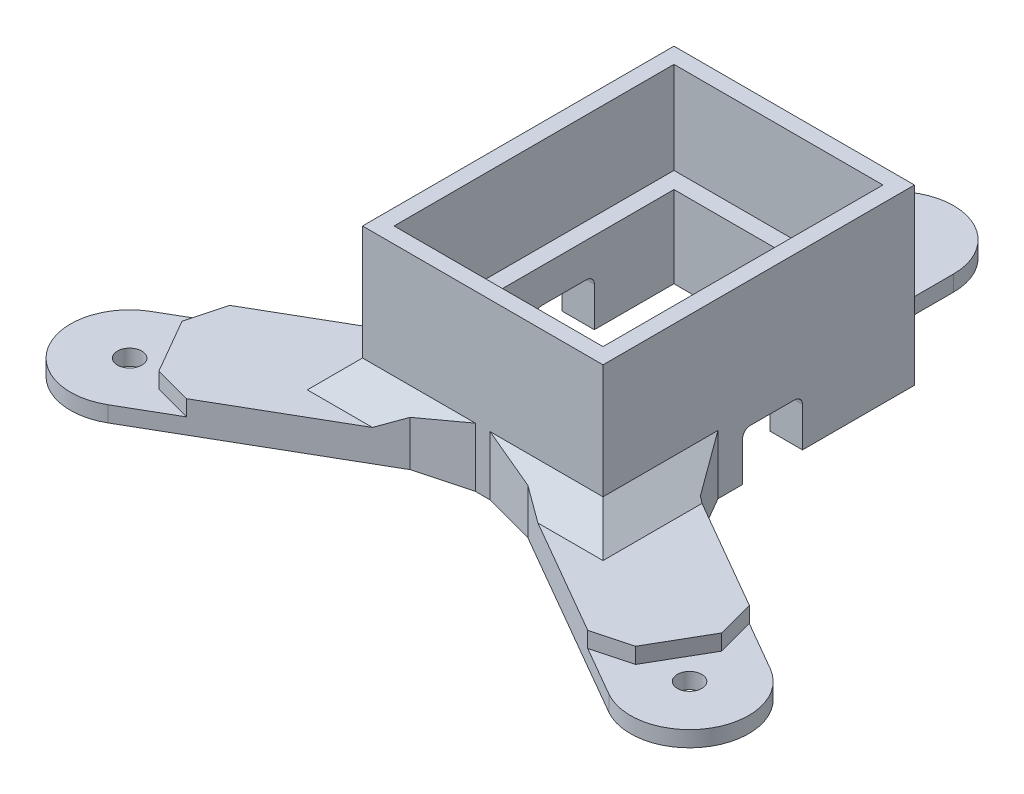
ISO-10303-21;
HEADER;
FILE_DESCRIPTION(('STEP AP214'),'2;1');
FILE_NAME('part.step','',(''),(''),'','','');
FILE_SCHEMA(('AUTOMOTIVE_DESIGN { 1 0 10303 214 1 1 1 1 }'));
ENDSEC;
DATA;
#1=APPLICATION_CONTEXT('core data for automotive mechanical design processes');
#2=APPLICATION_PROTOCOL_DEFINITION('international standard','automotive_design',2000,#1);
#3=PRODUCT_CONTEXT('',#1,'mechanical');
#4=PRODUCT('Part','Part','',(#3));
#5=PRODUCT_RELATED_PRODUCT_CATEGORY('part','',(#4));
#6=PRODUCT_DEFINITION_FORMATION('','',#4);
#7=PRODUCT_DEFINITION_CONTEXT('part definition',#1,'design');
#8=PRODUCT_DEFINITION('design','',#6,#7);
#9=PRODUCT_DEFINITION_SHAPE('','',#8);
#10=(LENGTH_UNIT() NAMED_UNIT(*) SI_UNIT(.MILLI.,.METRE.));
#11=(NAMED_UNIT(*) PLANE_ANGLE_UNIT() SI_UNIT($,.RADIAN.));
#12=(NAMED_UNIT(*) SI_UNIT($,.STERADIAN.) SOLID_ANGLE_UNIT());
#13=UNCERTAINTY_MEASURE_WITH_UNIT(LENGTH_MEASURE(1.E-05),#10,'distance_accuracy_value','');
#14=(GEOMETRIC_REPRESENTATION_CONTEXT(3) GLOBAL_UNCERTAINTY_ASSIGNED_CONTEXT((#13)) GLOBAL_UNIT_ASSIGNED_CONTEXT((#10,
#11,#12)) REPRESENTATION_CONTEXT('',''));
#15=CARTESIAN_POINT('',(0.,0.,0.));
#16=DIRECTION('',(0.,0.,1.));
#17=DIRECTION('',(1.,0.,0.));
#18=AXIS2_PLACEMENT_3D('',#15,#16,#17);
#19=CARTESIAN_POINT('',(0.,4.,-32.47));
#20=DIRECTION('',(0.,-1.,0.));
#21=DIRECTION('',(0.,0.,-1.));
#22=AXIS2_PLACEMENT_3D('',#19,#20,#21);
#23=CYLINDRICAL_SURFACE('',#22,7.5);
#24=CARTESIAN_POINT('',(0.,2.,-32.47));
#25=DIRECTION('',(0.,1.,0.));
#26=DIRECTION('',(0.,0.,1.));
#27=AXIS2_PLACEMENT_3D('',#24,#25,#26);
#28=CIRCLE('',#27,7.5);
#29=CARTESIAN_POINT('',(-7.5,2.,-32.47));
#30=VERTEX_POINT('',#29);
#31=CARTESIAN_POINT('',(7.5,2.,-32.47));
#32=VERTEX_POINT('',#31);
#33=EDGE_CURVE('E939',#30,#32,#28,.F.);
#34=ORIENTED_EDGE('',*,*,#33,.T.);
#35=DIRECTION('',(0.,-1.,0.));
#36=VECTOR('',#35,1.);
#37=CARTESIAN_POINT('',(7.5,4.,-32.47));
#38=LINE('',#37,#36);
#39=CARTESIAN_POINT('',(7.5,0.,-32.47));
#40=VERTEX_POINT('',#39);
#41=EDGE_CURVE('E490',#32,#40,#38,.T.);
#42=ORIENTED_EDGE('',*,*,#41,.T.);
#43=CARTESIAN_POINT('',(0.,0.,-32.47));
#44=DIRECTION('',(0.,1.,0.));
#45=DIRECTION('',(0.,0.,1.));
#46=AXIS2_PLACEMENT_3D('',#43,#44,#45);
#47=CIRCLE('',#46,7.5);
#48=CARTESIAN_POINT('',(-7.5,0.,-32.47));
#49=VERTEX_POINT('',#48);
#50=EDGE_CURVE('E480',#40,#49,#47,.T.);
#51=ORIENTED_EDGE('',*,*,#50,.T.);
#52=DIRECTION('',(0.,-1.,0.));
#53=VECTOR('',#52,1.);
#54=CARTESIAN_POINT('',(-7.5,4.,-32.47));
#55=LINE('',#54,#53);
#56=EDGE_CURVE('E503',#30,#49,#55,.T.);
#57=ORIENTED_EDGE('',*,*,#56,.F.);
#58=EDGE_LOOP('',(#34,#42,#51,#57));
#59=FACE_BOUND('',#58,.T.);
#60=ADVANCED_FACE('F50',(#59),#23,.T.);
#61=CARTESIAN_POINT('',(-35.507041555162,4.,29.0299999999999));
#62=DIRECTION('',(0.,-1.,0.));
#63=DIRECTION('',(0.,0.,-1.));
#64=AXIS2_PLACEMENT_3D('',#61,#62,#63);
#65=CYLINDRICAL_SURFACE('',#64,7.49999999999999);
#66=CARTESIAN_POINT('',(-35.507041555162,2.,29.0299999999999));
#67=DIRECTION('',(0.,1.,0.));
#68=DIRECTION('',(0.,0.,1.));
#69=AXIS2_PLACEMENT_3D('',#66,#67,#68);
#70=CIRCLE('',#69,7.49999999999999);
#71=CARTESIAN_POINT('',(-31.757041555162,2.,35.5251905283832));
#72=VERTEX_POINT('',#71);
#73=CARTESIAN_POINT('',(-39.257041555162,2.,22.5348094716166));
#74=VERTEX_POINT('',#73);
#75=EDGE_CURVE('E416',#72,#74,#70,.F.);
#76=ORIENTED_EDGE('',*,*,#75,.T.);
#77=DIRECTION('',(0.,-1.,0.));
#78=VECTOR('',#77,1.);
#79=CARTESIAN_POINT('',(-39.257041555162,4.,22.5348094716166));
#80=LINE('',#79,#78);
#81=CARTESIAN_POINT('',(-39.257041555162,0.,22.5348094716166));
#82=VERTEX_POINT('',#81);
#83=EDGE_CURVE('E433',#74,#82,#80,.T.);
#84=ORIENTED_EDGE('',*,*,#83,.T.);
#85=CARTESIAN_POINT('',(-35.507041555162,0.,29.0299999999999));
#86=DIRECTION('',(0.,1.,0.));
#87=DIRECTION('',(0.,0.,1.));
#88=AXIS2_PLACEMENT_3D('',#85,#86,#87);
#89=CIRCLE('',#88,7.49999999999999);
#90=CARTESIAN_POINT('',(-31.757041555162,0.,35.5251905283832));
#91=VERTEX_POINT('',#90);
#92=EDGE_CURVE('E461',#82,#91,#89,.T.);
#93=ORIENTED_EDGE('',*,*,#92,.T.);
#94=DIRECTION('',(0.,-1.,0.));
#95=VECTOR('',#94,1.);
#96=CARTESIAN_POINT('',(-31.757041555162,4.,35.5251905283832));
#97=LINE('',#96,#95);
#98=EDGE_CURVE('E435',#72,#91,#97,.T.);
#99=ORIENTED_EDGE('',*,*,#98,.F.);
#100=EDGE_LOOP('',(#76,#84,#93,#99));
#101=FACE_BOUND('',#100,.T.);
#102=ADVANCED_FACE('F431',(#101),#65,.T.);
#103=CARTESIAN_POINT('',(35.507041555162,4.,29.0299999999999));
#104=DIRECTION('',(0.,-1.,0.));
#105=DIRECTION('',(0.,0.,-1.));
#106=AXIS2_PLACEMENT_3D('',#103,#104,#105);
#107=CYLINDRICAL_SURFACE('',#106,7.49999999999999);
#108=CARTESIAN_POINT('',(35.507041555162,2.,29.0299999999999));
#109=DIRECTION('',(0.,1.,0.));
#110=DIRECTION('',(0.,0.,1.));
#111=AXIS2_PLACEMENT_3D('',#108,#109,#110);
#112=CIRCLE('',#111,7.5);
#113=CARTESIAN_POINT('',(39.257041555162,2.,22.5348094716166));
#114=VERTEX_POINT('',#113);
#115=CARTESIAN_POINT('',(31.757041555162,2.,35.5251905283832));
#116=VERTEX_POINT('',#115);
#117=EDGE_CURVE('E891',#114,#116,#112,.F.);
#118=ORIENTED_EDGE('',*,*,#117,.T.);
#119=DIRECTION('',(0.,-1.,0.));
#120=VECTOR('',#119,1.);
#121=CARTESIAN_POINT('',(31.757041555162,4.,35.5251905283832));
#122=LINE('',#121,#120);
#123=CARTESIAN_POINT('',(31.757041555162,0.,35.5251905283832));
#124=VERTEX_POINT('',#123);
#125=EDGE_CURVE('E452',#116,#124,#122,.T.);
#126=ORIENTED_EDGE('',*,*,#125,.T.);
#127=CARTESIAN_POINT('',(35.507041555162,0.,29.0299999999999));
#128=DIRECTION('',(0.,1.,0.));
#129=DIRECTION('',(0.,0.,1.));
#130=AXIS2_PLACEMENT_3D('',#127,#128,#129);
#131=CIRCLE('',#130,7.49999999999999);
#132=CARTESIAN_POINT('',(39.257041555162,0.,22.5348094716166));
#133=VERTEX_POINT('',#132);
#134=EDGE_CURVE('E1063',#124,#133,#131,.T.);
#135=ORIENTED_EDGE('',*,*,#134,.T.);
#136=DIRECTION('',(0.,-1.,0.));
#137=VECTOR('',#136,1.);
#138=CARTESIAN_POINT('',(39.257041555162,4.,22.5348094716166));
#139=LINE('',#138,#137);
#140=EDGE_CURVE('E455',#114,#133,#139,.T.);
#141=ORIENTED_EDGE('',*,*,#140,.F.);
#142=EDGE_LOOP('',(#118,#126,#135,#141));
#143=FACE_BOUND('',#142,.T.);
#144=ADVANCED_FACE('F1079',(#143),#107,.T.);
#145=CARTESIAN_POINT('',(0.,0.,0.));
#146=DIRECTION('',(0.,1.,0.));
#147=DIRECTION('',(0.,0.,1.));
#148=AXIS2_PLACEMENT_3D('',#145,#146,#147);
#149=PLANE('',#148);
#150=CARTESIAN_POINT('',(0.,0.,-32.47));
#151=DIRECTION('',(0.,1.,0.));
#152=DIRECTION('',(0.,0.,1.));
#153=AXIS2_PLACEMENT_3D('',#150,#151,#152);
#154=CIRCLE('',#153,1.55);
#155=CARTESIAN_POINT('',(0.,0.,-30.92));
#156=VERTEX_POINT('',#155);
#157=EDGE_CURVE('E476',#156,#156,#154,.T.);
#158=ORIENTED_EDGE('',*,*,#157,.T.);
#159=EDGE_LOOP('',(#158));
#160=FACE_BOUND('',#159,.T.);
#161=DIRECTION('',(0.,0.,-1.));
#162=VECTOR('',#161,1.);
#163=CARTESIAN_POINT('',(15.25,0.,19.75));
#164=LINE('',#163,#162);
#165=CARTESIAN_POINT('',(15.25,0.,-5.55));
#166=VERTEX_POINT('',#165);
#167=CARTESIAN_POINT('',(15.25,0.,-19.75));
#168=VERTEX_POINT('',#167);
#169=EDGE_CURVE('E599',#166,#168,#164,.T.);
#170=ORIENTED_EDGE('',*,*,#169,.F.);
#171=DIRECTION('',(1.,0.,0.));
#172=VECTOR('',#171,1.);
#173=CARTESIAN_POINT('',(-43.007041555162,0.,-5.55));
#174=LINE('',#173,#172);
#175=CARTESIAN_POINT('',(11.15,0.,-5.55));
#176=VERTEX_POINT('',#175);
#177=EDGE_CURVE('E986',#176,#166,#174,.T.);
#178=ORIENTED_EDGE('',*,*,#177,.F.);
#179=DIRECTION('',(0.,0.,1.));
#180=VECTOR('',#179,1.);
#181=CARTESIAN_POINT('',(11.15,0.,-15.65));
#182=LINE('',#181,#180);
#183=CARTESIAN_POINT('',(11.15,0.,-15.65));
#184=VERTEX_POINT('',#183);
#185=EDGE_CURVE('E512',#184,#176,#182,.T.);
#186=ORIENTED_EDGE('',*,*,#185,.F.);
#187=DIRECTION('',(1.,0.,0.));
#188=VECTOR('',#187,1.);
#189=CARTESIAN_POINT('',(-11.15,0.,-15.65));
#190=LINE('',#189,#188);
#191=CARTESIAN_POINT('',(-11.15,0.,-15.65));
#192=VERTEX_POINT('',#191);
#193=EDGE_CURVE('E532',#192,#184,#190,.T.);
#194=ORIENTED_EDGE('',*,*,#193,.F.);
#195=DIRECTION('',(0.,0.,-1.));
#196=VECTOR('',#195,1.);
#197=CARTESIAN_POINT('',(-11.15,0.,15.65));
#198=LINE('',#197,#196);
#199=CARTESIAN_POINT('',(-11.15,0.,-5.55));
#200=VERTEX_POINT('',#199);
#201=EDGE_CURVE('E527',#200,#192,#198,.T.);
#202=ORIENTED_EDGE('',*,*,#201,.F.);
#203=CARTESIAN_POINT('',(-15.25,0.,-5.55));
#204=VERTEX_POINT('',#203);
#205=EDGE_CURVE('E989',#204,#200,#174,.T.);
#206=ORIENTED_EDGE('',*,*,#205,.F.);
#207=DIRECTION('',(0.,0.,1.));
#208=VECTOR('',#207,1.);
#209=CARTESIAN_POINT('',(-15.25,0.,19.75));
#210=LINE('',#209,#208);
#211=CARTESIAN_POINT('',(-15.25,0.,-19.75));
#212=VERTEX_POINT('',#211);
#213=EDGE_CURVE('E624',#212,#204,#210,.T.);
#214=ORIENTED_EDGE('',*,*,#213,.F.);
#215=DIRECTION('',(-1.,0.,0.));
#216=VECTOR('',#215,1.);
#217=CARTESIAN_POINT('',(15.25,0.,-19.75));
#218=LINE('',#217,#216);
#219=CARTESIAN_POINT('',(-11.,0.,-19.75));
#220=VERTEX_POINT('',#219);
#221=EDGE_CURVE('E618',#220,#212,#218,.T.);
#222=ORIENTED_EDGE('',*,*,#221,.F.);
#223=DIRECTION('',(-0.707106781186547,0.,0.707106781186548));
#224=VECTOR('',#223,1.);
#225=CARTESIAN_POINT('',(-15.375,0.,-15.375));
#226=LINE('',#225,#224);
#227=CARTESIAN_POINT('',(-7.5,0.,-23.25));
#228=VERTEX_POINT('',#227);
#229=EDGE_CURVE('E719',#220,#228,#226,.F.);
#230=ORIENTED_EDGE('',*,*,#229,.T.);
#231=DIRECTION('',(0.,0.,1.));
#232=VECTOR('',#231,1.);
#233=CARTESIAN_POINT('',(-7.5,0.,0.));
#234=LINE('',#233,#232);
#235=EDGE_CURVE('E494',#49,#228,#234,.T.);
#236=ORIENTED_EDGE('',*,*,#235,.F.);
#237=ORIENTED_EDGE('',*,*,#50,.F.);
#238=DIRECTION('',(0.,0.,-1.));
#239=VECTOR('',#238,1.);
#240=CARTESIAN_POINT('',(7.5,0.,0.));
#241=LINE('',#240,#239);
#242=CARTESIAN_POINT('',(7.5,0.,-23.25));
#243=VERTEX_POINT('',#242);
#244=EDGE_CURVE('E486',#243,#40,#241,.T.);
#245=ORIENTED_EDGE('',*,*,#244,.F.);
#246=DIRECTION('',(-0.707106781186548,0.,-0.707106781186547));
#247=VECTOR('',#246,1.);
#248=CARTESIAN_POINT('',(15.375,0.,-15.375));
#249=LINE('',#248,#247);
#250=CARTESIAN_POINT('',(11.,0.,-19.75));
#251=VERTEX_POINT('',#250);
#252=EDGE_CURVE('E716',#243,#251,#249,.F.);
#253=ORIENTED_EDGE('',*,*,#252,.T.);
#254=EDGE_CURVE('E619',#168,#251,#218,.T.);
#255=ORIENTED_EDGE('',*,*,#254,.F.);
#256=EDGE_LOOP('',(#170,#178,#186,#194,#202,#206,#214,#222,#230,#236,#237,#245,#253,#255));
#257=FACE_BOUND('',#256,.T.);
#258=ADVANCED_FACE('F1122',(#160,#257),#149,.F.);
#259=CARTESIAN_POINT('',(0.,4.,-32.47));
#260=DIRECTION('',(0.,-1.,0.));
#261=DIRECTION('',(0.,0.,-1.));
#262=AXIS2_PLACEMENT_3D('',#259,#260,#261);
#263=CYLINDRICAL_SURFACE('',#262,1.55);
#264=ORIENTED_EDGE('',*,*,#157,.F.);
#265=EDGE_LOOP('',(#264));
#266=FACE_BOUND('',#265,.T.);
#267=CARTESIAN_POINT('',(0.,2.,-32.47));
#268=DIRECTION('',(0.,1.,0.));
#269=DIRECTION('',(0.,0.,1.));
#270=AXIS2_PLACEMENT_3D('',#267,#268,#269);
#271=CIRCLE('',#270,1.55);
#272=CARTESIAN_POINT('',(0.,2.,-30.92));
#273=VERTEX_POINT('',#272);
#274=EDGE_CURVE('E651',#273,#273,#271,.T.);
#275=ORIENTED_EDGE('',*,*,#274,.T.);
#276=EDGE_LOOP('',(#275));
#277=FACE_BOUND('',#276,.T.);
#278=ADVANCED_FACE('F1515',(#266,#277),#263,.F.);
#279=CARTESIAN_POINT('',(0.,4.,-32.47));
#280=DIRECTION('',(0.,1.,0.));
#281=DIRECTION('',(0.,0.,1.));
#282=AXIS2_PLACEMENT_3D('',#279,#280,#281);
#283=PLANE('',#282);
#284=DIRECTION('',(0.,0.,1.));
#285=VECTOR('',#284,1.);
#286=CARTESIAN_POINT('',(-7.5,4.,0.));
#287=LINE('',#286,#285);
#288=CARTESIAN_POINT('',(-7.5,4.,-25.1791034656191));
#289=VERTEX_POINT('',#288);
#290=CARTESIAN_POINT('',(-7.5,4.,-23.25));
#291=VERTEX_POINT('',#290);
#292=EDGE_CURVE('E481',#289,#291,#287,.T.);
#293=ORIENTED_EDGE('',*,*,#292,.T.);
#294=DIRECTION('',(1.,0.,0.));
#295=VECTOR('',#294,1.);
#296=CARTESIAN_POINT('',(0.,4.,-23.25));
#297=LINE('',#296,#295);
#298=CARTESIAN_POINT('',(7.5,4.,-23.25));
#299=VERTEX_POINT('',#298);
#300=EDGE_CURVE('E843',#291,#299,#297,.T.);
#301=ORIENTED_EDGE('',*,*,#300,.T.);
#302=DIRECTION('',(0.,0.,-1.));
#303=VECTOR('',#302,1.);
#304=CARTESIAN_POINT('',(7.5,4.,0.));
#305=LINE('',#304,#303);
#306=CARTESIAN_POINT('',(7.5,4.,-25.1791034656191));
#307=VERTEX_POINT('',#306);
#308=EDGE_CURVE('E485',#299,#307,#305,.T.);
#309=ORIENTED_EDGE('',*,*,#308,.T.);
#310=DIRECTION('',(0.707106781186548,0.,0.707106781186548));
#311=VECTOR('',#310,1.);
#312=CARTESIAN_POINT('',(0.104551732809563,4.,-32.5745517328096));
#313=LINE('',#312,#311);
#314=CARTESIAN_POINT('',(4.,4.,-28.6791034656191));
#315=VERTEX_POINT('',#314);
#316=EDGE_CURVE('E741',#307,#315,#313,.F.);
#317=ORIENTED_EDGE('',*,*,#316,.T.);
#318=DIRECTION('',(1.,0.,0.));
#319=VECTOR('',#318,1.);
#320=CARTESIAN_POINT('',(-7.5,4.,-28.6791034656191));
#321=LINE('',#320,#319);
#322=CARTESIAN_POINT('',(-3.99999999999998,4.,-28.6791034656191));
#323=VERTEX_POINT('',#322);
#324=EDGE_CURVE('E933',#323,#315,#321,.T.);
#325=ORIENTED_EDGE('',*,*,#324,.F.);
#326=DIRECTION('',(0.707106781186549,0.,-0.707106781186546));
#327=VECTOR('',#326,1.);
#328=CARTESIAN_POINT('',(-0.104551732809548,4.,-32.5745517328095));
#329=LINE('',#328,#327);
#330=EDGE_CURVE('E744',#323,#289,#329,.F.);
#331=ORIENTED_EDGE('',*,*,#330,.T.);
#332=EDGE_LOOP('',(#293,#301,#309,#317,#325,#331));
#333=FACE_BOUND('',#332,.T.);
#334=ADVANCED_FACE('F1505',(#333),#283,.T.);
#335=CARTESIAN_POINT('',(35.507041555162,4.,29.0299999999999));
#336=DIRECTION('',(0.,1.,0.));
#337=DIRECTION('',(0.,0.,1.));
#338=AXIS2_PLACEMENT_3D('',#335,#336,#337);
#339=PLANE('',#338);
#340=DIRECTION('',(0.86602540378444,0.,0.499999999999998));
#341=VECTOR('',#340,1.);
#342=CARTESIAN_POINT('',(0.0564016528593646,4.,-0.0976905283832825));
#343=LINE('',#342,#341);
#344=CARTESIAN_POINT('',(18.75,4.,10.6950635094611));
#345=VERTEX_POINT('',#344);
#346=CARTESIAN_POINT('',(32.9429399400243,4.,18.8893612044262));
#347=VERTEX_POINT('',#346);
#348=EDGE_CURVE('E1053',#345,#347,#343,.T.);
#349=ORIENTED_EDGE('',*,*,#348,.F.);
#350=DIRECTION('',(0.,0.,1.));
#351=VECTOR('',#350,1.);
#352=CARTESIAN_POINT('',(18.75,4.,29.0299999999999));
#353=LINE('',#352,#351);
#354=CARTESIAN_POINT('',(18.75,4.,23.25));
#355=VERTEX_POINT('',#354);
#356=EDGE_CURVE('E823',#345,#355,#353,.T.);
#357=ORIENTED_EDGE('',*,*,#356,.T.);
#358=DIRECTION('',(-1.,0.,0.));
#359=VECTOR('',#358,1.);
#360=CARTESIAN_POINT('',(35.507041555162,4.,23.25));
#361=LINE('',#360,#359);
#362=CARTESIAN_POINT('',(10.495787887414,4.,23.25));
#363=VERTEX_POINT('',#362);
#364=EDGE_CURVE('E820',#355,#363,#361,.T.);
#365=ORIENTED_EDGE('',*,*,#364,.T.);
#366=DIRECTION('',(-0.86602540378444,0.,-0.499999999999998));
#367=VECTOR('',#366,1.);
#368=CARTESIAN_POINT('',(-7.44359834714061,4.,12.8926905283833));
#369=LINE('',#368,#367);
#370=CARTESIAN_POINT('',(25.4429399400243,4.,31.8797422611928));
#371=VERTEX_POINT('',#370);
#372=EDGE_CURVE('E1056',#371,#363,#369,.T.);
#373=ORIENTED_EDGE('',*,*,#372,.F.);
#374=DIRECTION('',(0.965925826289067,0.,-0.258819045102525));
#375=VECTOR('',#374,1.);
#376=CARTESIAN_POINT('',(35.54531014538,4.,29.1728203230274));
#377=LINE('',#376,#375);
#378=CARTESIAN_POINT('',(30.2240288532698,4.,30.5986533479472));
#379=VERTEX_POINT('',#378);
#380=EDGE_CURVE('E762',#371,#379,#377,.T.);
#381=ORIENTED_EDGE('',*,*,#380,.T.);
#382=DIRECTION('',(-0.499999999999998,0.,0.86602540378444));
#383=VECTOR('',#382,1.);
#384=CARTESIAN_POINT('',(35.9740288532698,4.,20.6393612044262));
#385=LINE('',#384,#383);
#386=CARTESIAN_POINT('',(34.2240288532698,4.,23.6704501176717));
#387=VERTEX_POINT('',#386);
#388=EDGE_CURVE('E940',#387,#379,#385,.T.);
#389=ORIENTED_EDGE('',*,*,#388,.F.);
#390=DIRECTION('',(-0.258819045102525,0.,-0.965925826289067));
#391=VECTOR('',#390,1.);
#392=CARTESIAN_POINT('',(35.6498618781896,4.,28.9917314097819));
#393=LINE('',#392,#391);
#394=EDGE_CURVE('E765',#387,#347,#393,.T.);
#395=ORIENTED_EDGE('',*,*,#394,.T.);
#396=EDGE_LOOP('',(#349,#357,#365,#373,#381,#389,#395));
#397=FACE_BOUND('',#396,.T.);
#398=ADVANCED_FACE('F1196',(#397),#339,.T.);
#399=CARTESIAN_POINT('',(35.507041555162,4.,29.0299999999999));
#400=DIRECTION('',(0.,-1.,0.));
#401=DIRECTION('',(0.,0.,-1.));
#402=AXIS2_PLACEMENT_3D('',#399,#400,#401);
#403=CYLINDRICAL_SURFACE('',#402,1.54999999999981);
#404=CARTESIAN_POINT('',(35.507041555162,0.,29.0299999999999));
#405=DIRECTION('',(0.,1.,0.));
#406=DIRECTION('',(0.,0.,1.));
#407=AXIS2_PLACEMENT_3D('',#404,#405,#406);
#408=CIRCLE('',#407,1.54999999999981);
#409=CARTESIAN_POINT('',(35.507041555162,0.,30.5799999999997));
#410=VERTEX_POINT('',#409);
#411=EDGE_CURVE('E656',#410,#410,#408,.T.);
#412=ORIENTED_EDGE('',*,*,#411,.F.);
#413=EDGE_LOOP('',(#412));
#414=FACE_BOUND('',#413,.T.);
#415=CARTESIAN_POINT('',(35.507041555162,2.,29.0299999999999));
#416=DIRECTION('',(0.,1.,0.));
#417=DIRECTION('',(0.,0.,1.));
#418=AXIS2_PLACEMENT_3D('',#415,#416,#417);
#419=CIRCLE('',#418,1.54999999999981);
#420=CARTESIAN_POINT('',(35.507041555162,2.,30.5799999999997));
#421=VERTEX_POINT('',#420);
#422=EDGE_CURVE('E647',#421,#421,#419,.T.);
#423=ORIENTED_EDGE('',*,*,#422,.T.);
#424=EDGE_LOOP('',(#423));
#425=FACE_BOUND('',#424,.T.);
#426=ADVANCED_FACE('F1504',(#414,#425),#403,.F.);
#427=CARTESIAN_POINT('',(-35.507041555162,4.,29.0299999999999));
#428=DIRECTION('',(0.,-1.,0.));
#429=DIRECTION('',(0.,0.,-1.));
#430=AXIS2_PLACEMENT_3D('',#427,#428,#429);
#431=CYLINDRICAL_SURFACE('',#430,1.54999999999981);
#432=CARTESIAN_POINT('',(-35.507041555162,0.,29.0299999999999));
#433=DIRECTION('',(0.,1.,0.));
#434=DIRECTION('',(0.,0.,1.));
#435=AXIS2_PLACEMENT_3D('',#432,#433,#434);
#436=CIRCLE('',#435,1.54999999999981);
#437=CARTESIAN_POINT('',(-35.507041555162,0.,30.5799999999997));
#438=VERTEX_POINT('',#437);
#439=EDGE_CURVE('E467',#438,#438,#436,.T.);
#440=ORIENTED_EDGE('',*,*,#439,.F.);
#441=EDGE_LOOP('',(#440));
#442=FACE_BOUND('',#441,.T.);
#443=CARTESIAN_POINT('',(-35.507041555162,2.,29.0299999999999));
#444=DIRECTION('',(0.,1.,0.));
#445=DIRECTION('',(0.,0.,1.));
#446=AXIS2_PLACEMENT_3D('',#443,#444,#445);
#447=CIRCLE('',#446,1.54999999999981);
#448=CARTESIAN_POINT('',(-35.507041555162,2.,30.5799999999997));
#449=VERTEX_POINT('',#448);
#450=EDGE_CURVE('E443',#449,#449,#447,.T.);
#451=ORIENTED_EDGE('',*,*,#450,.T.);
#452=EDGE_LOOP('',(#451));
#453=FACE_BOUND('',#452,.T.);
#454=ADVANCED_FACE('F1276',(#442,#453),#431,.F.);
#455=CARTESIAN_POINT('',(15.25,22.,-19.75));
#456=DIRECTION('',(0.,0.,1.));
#457=DIRECTION('',(1.,0.,0.));
#458=AXIS2_PLACEMENT_3D('',#455,#456,#457);
#459=PLANE('',#458);
#460=DIRECTION('',(0.,1.,0.));
#461=VECTOR('',#460,1.);
#462=CARTESIAN_POINT('',(11.,4.,-19.75));
#463=LINE('',#462,#461);
#464=CARTESIAN_POINT('',(11.,7.49999999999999,-19.75));
#465=VERTEX_POINT('',#464);
#466=EDGE_CURVE('E684',#251,#465,#463,.T.);
#467=ORIENTED_EDGE('',*,*,#466,.T.);
#468=DIRECTION('',(-1.,0.,0.));
#469=VECTOR('',#468,1.);
#470=CARTESIAN_POINT('',(15.25,7.49999999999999,-19.75));
#471=LINE('',#470,#469);
#472=CARTESIAN_POINT('',(-11.,7.49999999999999,-19.75));
#473=VERTEX_POINT('',#472);
#474=EDGE_CURVE('E847',#465,#473,#471,.T.);
#475=ORIENTED_EDGE('',*,*,#474,.T.);
#476=DIRECTION('',(0.,-1.,0.));
#477=VECTOR('',#476,1.);
#478=CARTESIAN_POINT('',(-11.,0.,-19.75));
#479=LINE('',#478,#477);
#480=EDGE_CURVE('E680',#473,#220,#479,.T.);
#481=ORIENTED_EDGE('',*,*,#480,.T.);
#482=ORIENTED_EDGE('',*,*,#221,.T.);
#483=DIRECTION('',(0.,-1.,0.));
#484=VECTOR('',#483,1.);
#485=CARTESIAN_POINT('',(-15.25,22.,-19.75));
#486=LINE('',#485,#484);
#487=CARTESIAN_POINT('',(-15.25,22.,-19.75));
#488=VERTEX_POINT('',#487);
#489=EDGE_CURVE('E638',#488,#212,#486,.T.);
#490=ORIENTED_EDGE('',*,*,#489,.F.);
#491=DIRECTION('',(-1.,0.,0.));
#492=VECTOR('',#491,1.);
#493=CARTESIAN_POINT('',(15.25,22.,-19.75));
#494=LINE('',#493,#492);
#495=CARTESIAN_POINT('',(15.25,22.,-19.75));
#496=VERTEX_POINT('',#495);
#497=EDGE_CURVE('E604',#496,#488,#494,.T.);
#498=ORIENTED_EDGE('',*,*,#497,.F.);
#499=DIRECTION('',(0.,-1.,0.));
#500=VECTOR('',#499,1.);
#501=CARTESIAN_POINT('',(15.25,22.,-19.75));
#502=LINE('',#501,#500);
#503=EDGE_CURVE('E642',#496,#168,#502,.T.);
#504=ORIENTED_EDGE('',*,*,#503,.T.);
#505=ORIENTED_EDGE('',*,*,#254,.T.);
#506=EDGE_LOOP('',(#467,#475,#481,#482,#490,#498,#504,#505));
#507=FACE_BOUND('',#506,.T.);
#508=ADVANCED_FACE('F1130',(#507),#459,.F.);
#509=CARTESIAN_POINT('',(-13.25,22.,17.75));
#510=DIRECTION('',(1.,0.,0.));
#511=DIRECTION('',(0.,0.,-1.));
#512=AXIS2_PLACEMENT_3D('',#509,#510,#511);
#513=PLANE('',#512);
#514=DIRECTION('',(0.,-1.,0.));
#515=VECTOR('',#514,1.);
#516=CARTESIAN_POINT('',(-13.25,22.,17.75));
#517=LINE('',#516,#515);
#518=CARTESIAN_POINT('',(-13.25,22.,17.75));
#519=VERTEX_POINT('',#518);
#520=CARTESIAN_POINT('',(-13.25,10.35,17.75));
#521=VERTEX_POINT('',#520);
#522=EDGE_CURVE('E595',#519,#521,#517,.T.);
#523=ORIENTED_EDGE('',*,*,#522,.T.);
#524=DIRECTION('',(0.,0.,-1.));
#525=VECTOR('',#524,1.);
#526=CARTESIAN_POINT('',(-13.25,10.35,17.75));
#527=LINE('',#526,#525);
#528=CARTESIAN_POINT('',(-13.25,10.35,-17.75));
#529=VERTEX_POINT('',#528);
#530=EDGE_CURVE('E544',#521,#529,#527,.T.);
#531=ORIENTED_EDGE('',*,*,#530,.T.);
#532=DIRECTION('',(0.,-1.,0.));
#533=VECTOR('',#532,1.);
#534=CARTESIAN_POINT('',(-13.25,22.,-17.75));
#535=LINE('',#534,#533);
#536=CARTESIAN_POINT('',(-13.25,22.,-17.75));
#537=VERTEX_POINT('',#536);
#538=EDGE_CURVE('E583',#537,#529,#535,.T.);
#539=ORIENTED_EDGE('',*,*,#538,.F.);
#540=DIRECTION('',(0.,0.,1.));
#541=VECTOR('',#540,1.);
#542=CARTESIAN_POINT('',(-13.25,22.,17.75));
#543=LINE('',#542,#541);
#544=EDGE_CURVE('E570',#537,#519,#543,.T.);
#545=ORIENTED_EDGE('',*,*,#544,.T.);
#546=EDGE_LOOP('',(#523,#531,#539,#545));
#547=FACE_BOUND('',#546,.T.);
#548=ADVANCED_FACE('F1261',(#547),#513,.T.);
#549=CARTESIAN_POINT('',(13.25,22.,17.75));
#550=DIRECTION('',(0.,0.,-1.));
#551=DIRECTION('',(-1.,0.,0.));
#552=AXIS2_PLACEMENT_3D('',#549,#550,#551);
#553=PLANE('',#552);
#554=DIRECTION('',(0.,-1.,0.));
#555=VECTOR('',#554,1.);
#556=CARTESIAN_POINT('',(13.25,22.,17.75));
#557=LINE('',#556,#555);
#558=CARTESIAN_POINT('',(13.25,22.,17.75));
#559=VERTEX_POINT('',#558);
#560=CARTESIAN_POINT('',(13.25,10.35,17.75));
#561=VERTEX_POINT('',#560);
#562=EDGE_CURVE('E591',#559,#561,#557,.T.);
#563=ORIENTED_EDGE('',*,*,#562,.T.);
#564=DIRECTION('',(-1.,0.,0.));
#565=VECTOR('',#564,1.);
#566=CARTESIAN_POINT('',(-13.25,10.35,17.75));
#567=LINE('',#566,#565);
#568=EDGE_CURVE('E566',#561,#521,#567,.T.);
#569=ORIENTED_EDGE('',*,*,#568,.T.);
#570=ORIENTED_EDGE('',*,*,#522,.F.);
#571=DIRECTION('',(1.,0.,0.));
#572=VECTOR('',#571,1.);
#573=CARTESIAN_POINT('',(13.25,22.,17.75));
#574=LINE('',#573,#572);
#575=EDGE_CURVE('E573',#519,#559,#574,.T.);
#576=ORIENTED_EDGE('',*,*,#575,.T.);
#577=EDGE_LOOP('',(#563,#569,#570,#576));
#578=FACE_BOUND('',#577,.T.);
#579=ADVANCED_FACE('F1257',(#578),#553,.T.);
#580=CARTESIAN_POINT('',(13.25,22.,17.75));
#581=DIRECTION('',(-1.,0.,0.));
#582=DIRECTION('',(0.,0.,1.));
#583=AXIS2_PLACEMENT_3D('',#580,#581,#582);
#584=PLANE('',#583);
#585=DIRECTION('',(0.,-1.,0.));
#586=VECTOR('',#585,1.);
#587=CARTESIAN_POINT('',(13.25,22.,-17.75));
#588=LINE('',#587,#586);
#589=CARTESIAN_POINT('',(13.25,22.,-17.75));
#590=VERTEX_POINT('',#589);
#591=CARTESIAN_POINT('',(13.25,10.35,-17.75));
#592=VERTEX_POINT('',#591);
#593=EDGE_CURVE('E587',#590,#592,#588,.T.);
#594=ORIENTED_EDGE('',*,*,#593,.T.);
#595=DIRECTION('',(0.,0.,1.));
#596=VECTOR('',#595,1.);
#597=CARTESIAN_POINT('',(13.25,10.35,17.75));
#598=LINE('',#597,#596);
#599=EDGE_CURVE('E562',#592,#561,#598,.T.);
#600=ORIENTED_EDGE('',*,*,#599,.T.);
#601=ORIENTED_EDGE('',*,*,#562,.F.);
#602=DIRECTION('',(0.,0.,-1.));
#603=VECTOR('',#602,1.);
#604=CARTESIAN_POINT('',(13.25,22.,17.75));
#605=LINE('',#604,#603);
#606=EDGE_CURVE('E576',#559,#590,#605,.T.);
#607=ORIENTED_EDGE('',*,*,#606,.T.);
#608=EDGE_LOOP('',(#594,#600,#601,#607));
#609=FACE_BOUND('',#608,.T.);
#610=ADVANCED_FACE('F1253',(#609),#584,.T.);
#611=CARTESIAN_POINT('',(13.25,22.,-17.75));
#612=DIRECTION('',(0.,0.,1.));
#613=DIRECTION('',(1.,0.,0.));
#614=AXIS2_PLACEMENT_3D('',#611,#612,#613);
#615=PLANE('',#614);
#616=ORIENTED_EDGE('',*,*,#538,.T.);
#617=DIRECTION('',(1.,0.,0.));
#618=VECTOR('',#617,1.);
#619=CARTESIAN_POINT('',(-13.25,10.35,-17.75));
#620=LINE('',#619,#618);
#621=EDGE_CURVE('E558',#529,#592,#620,.T.);
#622=ORIENTED_EDGE('',*,*,#621,.T.);
#623=ORIENTED_EDGE('',*,*,#593,.F.);
#624=DIRECTION('',(-1.,0.,0.));
#625=VECTOR('',#624,1.);
#626=CARTESIAN_POINT('',(13.25,22.,-17.75));
#627=LINE('',#626,#625);
#628=EDGE_CURVE('E580',#590,#537,#627,.T.);
#629=ORIENTED_EDGE('',*,*,#628,.T.);
#630=EDGE_LOOP('',(#616,#622,#623,#629));
#631=FACE_BOUND('',#630,.T.);
#632=ADVANCED_FACE('F1250',(#631),#615,.T.);
#633=CARTESIAN_POINT('',(0.,22.,0.));
#634=DIRECTION('',(0.,1.,0.));
#635=DIRECTION('',(0.,0.,1.));
#636=AXIS2_PLACEMENT_3D('',#633,#634,#635);
#637=PLANE('',#636);
#638=DIRECTION('',(0.,0.,-1.));
#639=VECTOR('',#638,1.);
#640=CARTESIAN_POINT('',(15.25,22.,19.75));
#641=LINE('',#640,#639);
#642=CARTESIAN_POINT('',(15.25,22.,19.75));
#643=VERTEX_POINT('',#642);
#644=EDGE_CURVE('E600',#643,#496,#641,.T.);
#645=ORIENTED_EDGE('',*,*,#644,.T.);
#646=ORIENTED_EDGE('',*,*,#497,.T.);
#647=DIRECTION('',(0.,0.,1.));
#648=VECTOR('',#647,1.);
#649=CARTESIAN_POINT('',(-15.25,22.,19.75));
#650=LINE('',#649,#648);
#651=CARTESIAN_POINT('',(-15.25,22.,19.75));
#652=VERTEX_POINT('',#651);
#653=EDGE_CURVE('E608',#488,#652,#650,.T.);
#654=ORIENTED_EDGE('',*,*,#653,.T.);
#655=DIRECTION('',(1.,0.,0.));
#656=VECTOR('',#655,1.);
#657=CARTESIAN_POINT('',(15.25,22.,19.75));
#658=LINE('',#657,#656);
#659=EDGE_CURVE('E611',#652,#643,#658,.T.);
#660=ORIENTED_EDGE('',*,*,#659,.T.);
#661=EDGE_LOOP('',(#645,#646,#654,#660));
#662=FACE_BOUND('',#661,.T.);
#663=ORIENTED_EDGE('',*,*,#575,.F.);
#664=ORIENTED_EDGE('',*,*,#544,.F.);
#665=ORIENTED_EDGE('',*,*,#628,.F.);
#666=ORIENTED_EDGE('',*,*,#606,.F.);
#667=EDGE_LOOP('',(#663,#664,#665,#666));
#668=FACE_BOUND('',#667,.T.);
#669=ADVANCED_FACE('F1112',(#662,#668),#637,.T.);
#670=CARTESIAN_POINT('',(-15.25,0.,2.05));
#671=VERTEX_POINT('',#670);
#672=CARTESIAN_POINT('',(-15.25,0.,5.17433756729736));
#673=VERTEX_POINT('',#672);
#674=EDGE_CURVE('E623',#671,#673,#210,.T.);
#675=ORIENTED_EDGE('',*,*,#674,.F.);
#676=DIRECTION('',(1.,0.,0.));
#677=VECTOR('',#676,1.);
#678=CARTESIAN_POINT('',(-43.007041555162,0.,2.05));
#679=LINE('',#678,#677);
#680=CARTESIAN_POINT('',(-11.15,0.,2.05));
#681=VERTEX_POINT('',#680);
#682=EDGE_CURVE('E990',#671,#681,#679,.T.);
#683=ORIENTED_EDGE('',*,*,#682,.T.);
#684=CARTESIAN_POINT('',(-11.15,0.,15.65));
#685=VERTEX_POINT('',#684);
#686=EDGE_CURVE('E528',#685,#681,#198,.T.);
#687=ORIENTED_EDGE('',*,*,#686,.F.);
#688=DIRECTION('',(-1.,0.,0.));
#689=VECTOR('',#688,1.);
#690=CARTESIAN_POINT('',(11.15,0.,15.65));
#691=LINE('',#690,#689);
#692=CARTESIAN_POINT('',(11.15,0.,15.65));
#693=VERTEX_POINT('',#692);
#694=EDGE_CURVE('E506',#693,#685,#691,.T.);
#695=ORIENTED_EDGE('',*,*,#694,.F.);
#696=CARTESIAN_POINT('',(11.15,0.,2.05));
#697=VERTEX_POINT('',#696);
#698=EDGE_CURVE('E536',#697,#693,#182,.T.);
#699=ORIENTED_EDGE('',*,*,#698,.F.);
#700=CARTESIAN_POINT('',(15.25,0.,2.05));
#701=VERTEX_POINT('',#700);
#702=EDGE_CURVE('E991',#697,#701,#679,.T.);
#703=ORIENTED_EDGE('',*,*,#702,.T.);
#704=CARTESIAN_POINT('',(15.25,0.,5.17433756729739));
#705=VERTEX_POINT('',#704);
#706=EDGE_CURVE('E615',#705,#701,#164,.T.);
#707=ORIENTED_EDGE('',*,*,#706,.F.);
#708=DIRECTION('',(0.500000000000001,0.,0.866025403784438));
#709=VECTOR('',#708,1.);
#710=CARTESIAN_POINT('',(9.19694610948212,0.,-5.309859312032));
#711=LINE('',#710,#709);
#712=CARTESIAN_POINT('',(18.2810889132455,0.,10.4243375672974));
#713=VERTEX_POINT('',#712);
#714=EDGE_CURVE('E731',#705,#713,#711,.T.);
#715=ORIENTED_EDGE('',*,*,#714,.T.);
#716=DIRECTION('',(0.86602540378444,0.,0.499999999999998));
#717=VECTOR('',#716,1.);
#718=CARTESIAN_POINT('',(0.0564016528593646,0.,-0.0976905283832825));
#719=LINE('',#718,#717);
#720=EDGE_CURVE('E1052',#713,#133,#719,.T.);
#721=ORIENTED_EDGE('',*,*,#720,.T.);
#722=ORIENTED_EDGE('',*,*,#134,.F.);
#723=DIRECTION('',(-0.86602540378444,0.,-0.499999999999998));
#724=VECTOR('',#723,1.);
#725=CARTESIAN_POINT('',(-7.44359834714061,0.,12.8926905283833));
#726=LINE('',#725,#724);
#727=CARTESIAN_POINT('',(7.46469897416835,0.,21.5));
#728=VERTEX_POINT('',#727);
#729=EDGE_CURVE('E1057',#124,#728,#726,.T.);
#730=ORIENTED_EDGE('',*,*,#729,.T.);
#731=DIRECTION('',(-0.965925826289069,0.,-0.258819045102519));
#732=VECTOR('',#731,1.);
#733=CARTESIAN_POINT('',(-4.87495998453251,0.,18.1935983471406));
#734=LINE('',#733,#732);
#735=CARTESIAN_POINT('',(0.933610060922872,0.,19.75));
#736=VERTEX_POINT('',#735);
#737=EDGE_CURVE('E728',#728,#736,#734,.T.);
#738=ORIENTED_EDGE('',*,*,#737,.T.);
#739=DIRECTION('',(1.,0.,0.));
#740=VECTOR('',#739,1.);
#741=CARTESIAN_POINT('',(15.25,0.,19.75));
#742=LINE('',#741,#740);
#743=CARTESIAN_POINT('',(-0.933610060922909,0.,19.75));
#744=VERTEX_POINT('',#743);
#745=EDGE_CURVE('E605',#744,#736,#742,.T.);
#746=ORIENTED_EDGE('',*,*,#745,.F.);
#747=DIRECTION('',(0.965925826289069,0.,-0.258819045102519));
#748=VECTOR('',#747,1.);
#749=CARTESIAN_POINT('',(4.87495998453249,0.,18.1935983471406));
#750=LINE('',#749,#748);
#751=CARTESIAN_POINT('',(-7.46469897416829,0.,21.4999999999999));
#752=VERTEX_POINT('',#751);
#753=EDGE_CURVE('E725',#744,#752,#750,.F.);
#754=ORIENTED_EDGE('',*,*,#753,.T.);
#755=DIRECTION('',(0.86602540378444,0.,-0.499999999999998));
#756=VECTOR('',#755,1.);
#757=CARTESIAN_POINT('',(7.44359834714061,0.,12.8926905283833));
#758=LINE('',#757,#756);
#759=EDGE_CURVE('E458',#91,#752,#758,.T.);
#760=ORIENTED_EDGE('',*,*,#759,.F.);
#761=ORIENTED_EDGE('',*,*,#92,.F.);
#762=DIRECTION('',(-0.86602540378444,0.,0.499999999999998));
#763=VECTOR('',#762,1.);
#764=CARTESIAN_POINT('',(-0.0564016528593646,0.,-0.0976905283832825));
#765=LINE('',#764,#763);
#766=CARTESIAN_POINT('',(-18.2810889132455,0.,10.4243375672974));
#767=VERTEX_POINT('',#766);
#768=EDGE_CURVE('E441',#767,#82,#765,.T.);
#769=ORIENTED_EDGE('',*,*,#768,.F.);
#770=DIRECTION('',(-0.500000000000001,0.,0.866025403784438));
#771=VECTOR('',#770,1.);
#772=CARTESIAN_POINT('',(-9.19694610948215,0.,-5.30985931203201));
#773=LINE('',#772,#771);
#774=EDGE_CURVE('E722',#767,#673,#773,.F.);
#775=ORIENTED_EDGE('',*,*,#774,.T.);
#776=EDGE_LOOP('',(#675,#683,#687,#695,#699,#703,#707,#715,#721,#722,#730,#738,#746,#754,#760,
#761,#769,#775));
#777=FACE_BOUND('',#776,.T.);
#778=ORIENTED_EDGE('',*,*,#439,.T.);
#779=EDGE_LOOP('',(#778));
#780=FACE_BOUND('',#779,.T.);
#781=ORIENTED_EDGE('',*,*,#411,.T.);
#782=EDGE_LOOP('',(#781));
#783=FACE_BOUND('',#782,.T.);
#784=ADVANCED_FACE('F1083',(#777,#780,#783),#149,.F.);
#785=CARTESIAN_POINT('',(15.25,22.,19.75));
#786=DIRECTION('',(-1.,0.,0.));
#787=DIRECTION('',(0.,0.,1.));
#788=AXIS2_PLACEMENT_3D('',#785,#786,#787);
#789=PLANE('',#788);
#790=DIRECTION('',(0.,-1.,0.));
#791=VECTOR('',#790,1.);
#792=CARTESIAN_POINT('',(15.25,22.,19.75));
#793=LINE('',#792,#791);
#794=CARTESIAN_POINT('',(15.25,7.50000000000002,19.75));
#795=VERTEX_POINT('',#794);
#796=EDGE_CURVE('E614',#643,#795,#793,.T.);
#797=ORIENTED_EDGE('',*,*,#796,.T.);
#798=DIRECTION('',(0.,0.,-1.));
#799=VECTOR('',#798,1.);
#800=CARTESIAN_POINT('',(15.25,7.50000000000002,19.75));
#801=LINE('',#800,#799);
#802=CARTESIAN_POINT('',(15.25,7.50000000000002,5.17433756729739));
#803=VERTEX_POINT('',#802);
#804=EDGE_CURVE('E816',#795,#803,#801,.T.);
#805=ORIENTED_EDGE('',*,*,#804,.T.);
#806=DIRECTION('',(0.,-1.,0.));
#807=VECTOR('',#806,1.);
#808=CARTESIAN_POINT('',(15.25,22.,5.17433756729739));
#809=LINE('',#808,#807);
#810=EDGE_CURVE('E709',#803,#705,#809,.T.);
#811=ORIENTED_EDGE('',*,*,#810,.T.);
#812=ORIENTED_EDGE('',*,*,#706,.T.);
#813=DIRECTION('',(0.,-1.,0.));
#814=VECTOR('',#813,1.);
#815=CARTESIAN_POINT('',(15.25,0.,2.05));
#816=LINE('',#815,#814);
#817=CARTESIAN_POINT('',(15.25,5.,2.05));
#818=VERTEX_POINT('',#817);
#819=EDGE_CURVE('E981',#818,#701,#816,.T.);
#820=ORIENTED_EDGE('',*,*,#819,.F.);
#821=CARTESIAN_POINT('',(15.25,5.,1.05));
#822=DIRECTION('',(1.,0.,0.));
#823=DIRECTION('',(0.,0.,-1.));
#824=AXIS2_PLACEMENT_3D('',#821,#822,#823);
#825=CIRCLE('',#824,1.);
#826=CARTESIAN_POINT('',(15.25,6.,1.05));
#827=VERTEX_POINT('',#826);
#828=EDGE_CURVE('E977',#827,#818,#825,.T.);
#829=ORIENTED_EDGE('',*,*,#828,.F.);
#830=DIRECTION('',(0.,0.,1.));
#831=VECTOR('',#830,1.);
#832=CARTESIAN_POINT('',(15.25,6.,-4.55));
#833=LINE('',#832,#831);
#834=CARTESIAN_POINT('',(15.25,6.,-4.55));
#835=VERTEX_POINT('',#834);
#836=EDGE_CURVE('E973',#835,#827,#833,.T.);
#837=ORIENTED_EDGE('',*,*,#836,.F.);
#838=CARTESIAN_POINT('',(15.25,5.,-4.55));
#839=DIRECTION('',(1.,0.,0.));
#840=DIRECTION('',(0.,0.,-1.));
#841=AXIS2_PLACEMENT_3D('',#838,#839,#840);
#842=CIRCLE('',#841,1.);
#843=CARTESIAN_POINT('',(15.25,5.,-5.55));
#844=VERTEX_POINT('',#843);
#845=EDGE_CURVE('E969',#844,#835,#842,.T.);
#846=ORIENTED_EDGE('',*,*,#845,.F.);
#847=DIRECTION('',(0.,1.,0.));
#848=VECTOR('',#847,1.);
#849=CARTESIAN_POINT('',(15.25,0.,-5.55));
#850=LINE('',#849,#848);
#851=EDGE_CURVE('E437',#166,#844,#850,.T.);
#852=ORIENTED_EDGE('',*,*,#851,.F.);
#853=ORIENTED_EDGE('',*,*,#169,.T.);
#854=ORIENTED_EDGE('',*,*,#503,.F.);
#855=ORIENTED_EDGE('',*,*,#644,.F.);
#856=EDGE_LOOP('',(#797,#805,#811,#812,#820,#829,#837,#846,#852,#853,#854,#855));
#857=FACE_BOUND('',#856,.T.);
#858=ADVANCED_FACE('F1187',(#857),#789,.F.);
#859=CARTESIAN_POINT('',(-15.25,22.,19.75));
#860=DIRECTION('',(1.,0.,0.));
#861=DIRECTION('',(0.,0.,-1.));
#862=AXIS2_PLACEMENT_3D('',#859,#860,#861);
#863=PLANE('',#862);
#864=DIRECTION('',(0.,1.,0.));
#865=VECTOR('',#864,1.);
#866=CARTESIAN_POINT('',(-15.25,4.,5.17433756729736));
#867=LINE('',#866,#865);
#868=CARTESIAN_POINT('',(-15.25,7.49999999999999,5.17433756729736));
#869=VERTEX_POINT('',#868);
#870=EDGE_CURVE('E693',#673,#869,#867,.T.);
#871=ORIENTED_EDGE('',*,*,#870,.T.);
#872=DIRECTION('',(0.,0.,1.));
#873=VECTOR('',#872,1.);
#874=CARTESIAN_POINT('',(-15.25,7.49999999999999,19.75));
#875=LINE('',#874,#873);
#876=CARTESIAN_POINT('',(-15.25,7.49999999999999,19.75));
#877=VERTEX_POINT('',#876);
#878=EDGE_CURVE('E840',#869,#877,#875,.T.);
#879=ORIENTED_EDGE('',*,*,#878,.T.);
#880=DIRECTION('',(0.,-1.,0.));
#881=VECTOR('',#880,1.);
#882=CARTESIAN_POINT('',(-15.25,22.,19.75));
#883=LINE('',#882,#881);
#884=EDGE_CURVE('E634',#652,#877,#883,.T.);
#885=ORIENTED_EDGE('',*,*,#884,.F.);
#886=ORIENTED_EDGE('',*,*,#653,.F.);
#887=ORIENTED_EDGE('',*,*,#489,.T.);
#888=ORIENTED_EDGE('',*,*,#213,.T.);
#889=DIRECTION('',(0.,1.,0.));
#890=VECTOR('',#889,1.);
#891=CARTESIAN_POINT('',(-15.25,22.,-5.55));
#892=LINE('',#891,#890);
#893=CARTESIAN_POINT('',(-15.25,5.,-5.55));
#894=VERTEX_POINT('',#893);
#895=EDGE_CURVE('E652',#204,#894,#892,.T.);
#896=ORIENTED_EDGE('',*,*,#895,.T.);
#897=CARTESIAN_POINT('',(-15.25,5.,-4.55));
#898=DIRECTION('',(1.,0.,0.));
#899=DIRECTION('',(0.,0.,-1.));
#900=AXIS2_PLACEMENT_3D('',#897,#898,#899);
#901=CIRCLE('',#900,1.);
#902=CARTESIAN_POINT('',(-15.25,6.,-4.55));
#903=VERTEX_POINT('',#902);
#904=EDGE_CURVE('E1014',#894,#903,#901,.T.);
#905=ORIENTED_EDGE('',*,*,#904,.T.);
#906=DIRECTION('',(0.,0.,1.));
#907=VECTOR('',#906,1.);
#908=CARTESIAN_POINT('',(-15.25,5.99999999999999,19.75));
#909=LINE('',#908,#907);
#910=CARTESIAN_POINT('',(-15.25,6.,1.05));
#911=VERTEX_POINT('',#910);
#912=EDGE_CURVE('E1022',#903,#911,#909,.T.);
#913=ORIENTED_EDGE('',*,*,#912,.T.);
#914=CARTESIAN_POINT('',(-15.25,5.,1.05));
#915=DIRECTION('',(1.,0.,0.));
#916=DIRECTION('',(0.,0.,-1.));
#917=AXIS2_PLACEMENT_3D('',#914,#915,#916);
#918=CIRCLE('',#917,1.);
#919=CARTESIAN_POINT('',(-15.25,5.,2.05));
#920=VERTEX_POINT('',#919);
#921=EDGE_CURVE('E1030',#911,#920,#918,.T.);
#922=ORIENTED_EDGE('',*,*,#921,.T.);
#923=DIRECTION('',(0.,-1.,0.));
#924=VECTOR('',#923,1.);
#925=CARTESIAN_POINT('',(-15.25,22.,2.05000000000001));
#926=LINE('',#925,#924);
#927=EDGE_CURVE('E1038',#920,#671,#926,.T.);
#928=ORIENTED_EDGE('',*,*,#927,.T.);
#929=ORIENTED_EDGE('',*,*,#674,.T.);
#930=EDGE_LOOP('',(#871,#879,#885,#886,#887,#888,#896,#905,#913,#922,#928,#929));
#931=FACE_BOUND('',#930,.T.);
#932=ADVANCED_FACE('F1103',(#931),#863,.F.);
#933=CARTESIAN_POINT('',(15.25,22.,19.75));
#934=DIRECTION('',(0.,0.,-1.));
#935=DIRECTION('',(-1.,0.,0.));
#936=AXIS2_PLACEMENT_3D('',#933,#934,#935);
#937=PLANE('',#936);
#938=DIRECTION('',(0.,1.,0.));
#939=VECTOR('',#938,1.);
#940=CARTESIAN_POINT('',(0.933610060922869,22.,19.75));
#941=LINE('',#940,#939);
#942=CARTESIAN_POINT('',(0.933610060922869,7.50000000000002,19.75));
#943=VERTEX_POINT('',#942);
#944=EDGE_CURVE('E696',#736,#943,#941,.T.);
#945=ORIENTED_EDGE('',*,*,#944,.T.);
#946=DIRECTION('',(1.,0.,0.));
#947=VECTOR('',#946,1.);
#948=CARTESIAN_POINT('',(15.25,7.50000000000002,19.75));
#949=LINE('',#948,#947);
#950=EDGE_CURVE('E830',#943,#795,#949,.T.);
#951=ORIENTED_EDGE('',*,*,#950,.T.);
#952=ORIENTED_EDGE('',*,*,#796,.F.);
#953=ORIENTED_EDGE('',*,*,#659,.F.);
#954=ORIENTED_EDGE('',*,*,#884,.T.);
#955=DIRECTION('',(1.,0.,0.));
#956=VECTOR('',#955,1.);
#957=CARTESIAN_POINT('',(15.25,7.49999999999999,19.75));
#958=LINE('',#957,#956);
#959=CARTESIAN_POINT('',(-0.933610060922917,7.49999999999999,19.75));
#960=VERTEX_POINT('',#959);
#961=EDGE_CURVE('E826',#877,#960,#958,.T.);
#962=ORIENTED_EDGE('',*,*,#961,.T.);
#963=DIRECTION('',(0.,-1.,0.));
#964=VECTOR('',#963,1.);
#965=CARTESIAN_POINT('',(-0.933610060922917,0.,19.75));
#966=LINE('',#965,#964);
#967=EDGE_CURVE('E699',#960,#744,#966,.T.);
#968=ORIENTED_EDGE('',*,*,#967,.T.);
#969=ORIENTED_EDGE('',*,*,#745,.T.);
#970=EDGE_LOOP('',(#945,#951,#952,#953,#954,#962,#968,#969));
#971=FACE_BOUND('',#970,.T.);
#972=ADVANCED_FACE('F1095',(#971),#937,.F.);
#973=CARTESIAN_POINT('',(0.,10.35,0.));
#974=DIRECTION('',(0.,-1.,0.));
#975=DIRECTION('',(0.,0.,-1.));
#976=AXIS2_PLACEMENT_3D('',#973,#974,#975);
#977=PLANE('',#976);
#978=DIRECTION('',(0.,0.,1.));
#979=VECTOR('',#978,1.);
#980=CARTESIAN_POINT('',(11.15,10.35,-15.65));
#981=LINE('',#980,#979);
#982=CARTESIAN_POINT('',(11.15,10.35,-15.65));
#983=VERTEX_POINT('',#982);
#984=CARTESIAN_POINT('',(11.15,10.35,15.65));
#985=VERTEX_POINT('',#984);
#986=EDGE_CURVE('E520',#983,#985,#981,.T.);
#987=ORIENTED_EDGE('',*,*,#986,.T.);
#988=DIRECTION('',(-1.,0.,0.));
#989=VECTOR('',#988,1.);
#990=CARTESIAN_POINT('',(11.15,10.35,15.65));
#991=LINE('',#990,#989);
#992=CARTESIAN_POINT('',(-11.15,10.35,15.65));
#993=VERTEX_POINT('',#992);
#994=EDGE_CURVE('E507',#985,#993,#991,.T.);
#995=ORIENTED_EDGE('',*,*,#994,.T.);
#996=DIRECTION('',(0.,0.,-1.));
#997=VECTOR('',#996,1.);
#998=CARTESIAN_POINT('',(-11.15,10.35,15.65));
#999=LINE('',#998,#997);
#1000=CARTESIAN_POINT('',(-11.15,10.35,-15.65));
#1001=VERTEX_POINT('',#1000);
#1002=EDGE_CURVE('E511',#993,#1001,#999,.T.);
#1003=ORIENTED_EDGE('',*,*,#1002,.T.);
#1004=DIRECTION('',(1.,0.,0.));
#1005=VECTOR('',#1004,1.);
#1006=CARTESIAN_POINT('',(-11.15,10.35,-15.65));
#1007=LINE('',#1006,#1005);
#1008=EDGE_CURVE('E516',#1001,#983,#1007,.T.);
#1009=ORIENTED_EDGE('',*,*,#1008,.T.);
#1010=EDGE_LOOP('',(#987,#995,#1003,#1009));
#1011=FACE_BOUND('',#1010,.T.);
#1012=ORIENTED_EDGE('',*,*,#530,.F.);
#1013=ORIENTED_EDGE('',*,*,#568,.F.);
#1014=ORIENTED_EDGE('',*,*,#599,.F.);
#1015=ORIENTED_EDGE('',*,*,#621,.F.);
#1016=EDGE_LOOP('',(#1012,#1013,#1014,#1015));
#1017=FACE_BOUND('',#1016,.T.);
#1018=ADVANCED_FACE('F1246',(#1011,#1017),#977,.F.);
#1019=CARTESIAN_POINT('',(11.15,10.35,15.65));
#1020=DIRECTION('',(0.,0.,1.));
#1021=DIRECTION('',(1.,0.,0.));
#1022=AXIS2_PLACEMENT_3D('',#1019,#1020,#1021);
#1023=PLANE('',#1022);
#1024=ORIENTED_EDGE('',*,*,#694,.T.);
#1025=DIRECTION('',(0.,-1.,0.));
#1026=VECTOR('',#1025,1.);
#1027=CARTESIAN_POINT('',(-11.15,10.35,15.65));
#1028=LINE('',#1027,#1026);
#1029=EDGE_CURVE('E524',#993,#685,#1028,.T.);
#1030=ORIENTED_EDGE('',*,*,#1029,.F.);
#1031=ORIENTED_EDGE('',*,*,#994,.F.);
#1032=DIRECTION('',(0.,-1.,0.));
#1033=VECTOR('',#1032,1.);
#1034=CARTESIAN_POINT('',(11.15,10.35,15.65));
#1035=LINE('',#1034,#1033);
#1036=EDGE_CURVE('E540',#985,#693,#1035,.T.);
#1037=ORIENTED_EDGE('',*,*,#1036,.T.);
#1038=EDGE_LOOP('',(#1024,#1030,#1031,#1037));
#1039=FACE_BOUND('',#1038,.T.);
#1040=ADVANCED_FACE('F1173',(#1039),#1023,.F.);
#1041=CARTESIAN_POINT('',(11.15,10.35,-15.65));
#1042=DIRECTION('',(1.,0.,0.));
#1043=DIRECTION('',(0.,0.,-1.));
#1044=AXIS2_PLACEMENT_3D('',#1041,#1042,#1043);
#1045=PLANE('',#1044);
#1046=ORIENTED_EDGE('',*,*,#185,.T.);
#1047=DIRECTION('',(0.,1.,0.));
#1048=VECTOR('',#1047,1.);
#1049=CARTESIAN_POINT('',(11.15,10.35,-5.55));
#1050=LINE('',#1049,#1048);
#1051=CARTESIAN_POINT('',(11.15,5.,-5.55));
#1052=VERTEX_POINT('',#1051);
#1053=EDGE_CURVE('E1042',#176,#1052,#1050,.T.);
#1054=ORIENTED_EDGE('',*,*,#1053,.T.);
#1055=CARTESIAN_POINT('',(11.15,5.,-4.55));
#1056=DIRECTION('',(1.,0.,0.));
#1057=DIRECTION('',(0.,0.,-1.));
#1058=AXIS2_PLACEMENT_3D('',#1055,#1056,#1057);
#1059=CIRCLE('',#1058,1.);
#1060=CARTESIAN_POINT('',(11.15,6.,-4.55));
#1061=VERTEX_POINT('',#1060);
#1062=EDGE_CURVE('E1010',#1052,#1061,#1059,.T.);
#1063=ORIENTED_EDGE('',*,*,#1062,.T.);
#1064=DIRECTION('',(0.,0.,1.));
#1065=VECTOR('',#1064,1.);
#1066=CARTESIAN_POINT('',(11.15,6.,-15.65));
#1067=LINE('',#1066,#1065);
#1068=CARTESIAN_POINT('',(11.15,6.,1.05));
#1069=VERTEX_POINT('',#1068);
#1070=EDGE_CURVE('E1018',#1061,#1069,#1067,.T.);
#1071=ORIENTED_EDGE('',*,*,#1070,.T.);
#1072=CARTESIAN_POINT('',(11.15,5.,1.05));
#1073=DIRECTION('',(1.,0.,0.));
#1074=DIRECTION('',(0.,0.,-1.));
#1075=AXIS2_PLACEMENT_3D('',#1072,#1073,#1074);
#1076=CIRCLE('',#1075,1.);
#1077=CARTESIAN_POINT('',(11.15,5.,2.05));
#1078=VERTEX_POINT('',#1077);
#1079=EDGE_CURVE('E1026',#1069,#1078,#1076,.T.);
#1080=ORIENTED_EDGE('',*,*,#1079,.T.);
#1081=DIRECTION('',(0.,-1.,0.));
#1082=VECTOR('',#1081,1.);
#1083=CARTESIAN_POINT('',(11.15,10.35,2.05000000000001));
#1084=LINE('',#1083,#1082);
#1085=EDGE_CURVE('E1034',#1078,#697,#1084,.T.);
#1086=ORIENTED_EDGE('',*,*,#1085,.T.);
#1087=ORIENTED_EDGE('',*,*,#698,.T.);
#1088=ORIENTED_EDGE('',*,*,#1036,.F.);
#1089=ORIENTED_EDGE('',*,*,#986,.F.);
#1090=DIRECTION('',(0.,-1.,0.));
#1091=VECTOR('',#1090,1.);
#1092=CARTESIAN_POINT('',(11.15,10.35,-15.65));
#1093=LINE('',#1092,#1091);
#1094=EDGE_CURVE('E545',#983,#184,#1093,.T.);
#1095=ORIENTED_EDGE('',*,*,#1094,.T.);
#1096=EDGE_LOOP('',(#1046,#1054,#1063,#1071,#1080,#1086,#1087,#1088,#1089,#1095));
#1097=FACE_BOUND('',#1096,.T.);
#1098=ADVANCED_FACE('F1177',(#1097),#1045,.F.);
#1099=CARTESIAN_POINT('',(-11.15,10.35,-15.65));
#1100=DIRECTION('',(0.,0.,-1.));
#1101=DIRECTION('',(-1.,0.,0.));
#1102=AXIS2_PLACEMENT_3D('',#1099,#1100,#1101);
#1103=PLANE('',#1102);
#1104=ORIENTED_EDGE('',*,*,#193,.T.);
#1105=ORIENTED_EDGE('',*,*,#1094,.F.);
#1106=ORIENTED_EDGE('',*,*,#1008,.F.);
#1107=DIRECTION('',(0.,-1.,0.));
#1108=VECTOR('',#1107,1.);
#1109=CARTESIAN_POINT('',(-11.15,10.35,-15.65));
#1110=LINE('',#1109,#1108);
#1111=EDGE_CURVE('E548',#1001,#192,#1110,.T.);
#1112=ORIENTED_EDGE('',*,*,#1111,.T.);
#1113=EDGE_LOOP('',(#1104,#1105,#1106,#1112));
#1114=FACE_BOUND('',#1113,.T.);
#1115=ADVANCED_FACE('F1238',(#1114),#1103,.F.);
#1116=CARTESIAN_POINT('',(-11.15,10.35,15.65));
#1117=DIRECTION('',(-1.,0.,0.));
#1118=DIRECTION('',(0.,0.,1.));
#1119=AXIS2_PLACEMENT_3D('',#1116,#1117,#1118);
#1120=PLANE('',#1119);
#1121=CARTESIAN_POINT('',(-11.15,5.,-4.55));
#1122=DIRECTION('',(-1.,0.,0.));
#1123=DIRECTION('',(0.,0.,1.));
#1124=AXIS2_PLACEMENT_3D('',#1121,#1122,#1123);
#1125=CIRCLE('',#1124,1.);
#1126=CARTESIAN_POINT('',(-11.15,6.,-4.55));
#1127=VERTEX_POINT('',#1126);
#1128=CARTESIAN_POINT('',(-11.15,5.,-5.55));
#1129=VERTEX_POINT('',#1128);
#1130=EDGE_CURVE('E645',#1127,#1129,#1125,.T.);
#1131=ORIENTED_EDGE('',*,*,#1130,.T.);
#1132=DIRECTION('',(0.,-1.,0.));
#1133=VECTOR('',#1132,1.);
#1134=CARTESIAN_POINT('',(-11.15,10.35,-5.55));
#1135=LINE('',#1134,#1133);
#1136=EDGE_CURVE('E672',#1129,#200,#1135,.T.);
#1137=ORIENTED_EDGE('',*,*,#1136,.T.);
#1138=ORIENTED_EDGE('',*,*,#201,.T.);
#1139=ORIENTED_EDGE('',*,*,#1111,.F.);
#1140=ORIENTED_EDGE('',*,*,#1002,.F.);
#1141=ORIENTED_EDGE('',*,*,#1029,.T.);
#1142=ORIENTED_EDGE('',*,*,#686,.T.);
#1143=DIRECTION('',(0.,1.,0.));
#1144=VECTOR('',#1143,1.);
#1145=CARTESIAN_POINT('',(-11.15,10.35,2.05000000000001));
#1146=LINE('',#1145,#1144);
#1147=CARTESIAN_POINT('',(-11.15,5.,2.05));
#1148=VERTEX_POINT('',#1147);
#1149=EDGE_CURVE('E668',#681,#1148,#1146,.T.);
#1150=ORIENTED_EDGE('',*,*,#1149,.T.);
#1151=CARTESIAN_POINT('',(-11.15,5.,1.05));
#1152=DIRECTION('',(-1.,0.,0.));
#1153=DIRECTION('',(0.,0.,1.));
#1154=AXIS2_PLACEMENT_3D('',#1151,#1152,#1153);
#1155=CIRCLE('',#1154,1.);
#1156=CARTESIAN_POINT('',(-11.15,6.,1.05));
#1157=VERTEX_POINT('',#1156);
#1158=EDGE_CURVE('E664',#1148,#1157,#1155,.T.);
#1159=ORIENTED_EDGE('',*,*,#1158,.T.);
#1160=DIRECTION('',(0.,0.,-1.));
#1161=VECTOR('',#1160,1.);
#1162=CARTESIAN_POINT('',(-11.15,6.,15.65));
#1163=LINE('',#1162,#1161);
#1164=EDGE_CURVE('E660',#1157,#1127,#1163,.T.);
#1165=ORIENTED_EDGE('',*,*,#1164,.T.);
#1166=EDGE_LOOP('',(#1131,#1137,#1138,#1139,#1140,#1141,#1142,#1150,#1159,#1165));
#1167=FACE_BOUND('',#1166,.T.);
#1168=ADVANCED_FACE('F1167',(#1167),#1120,.F.);
#1169=CARTESIAN_POINT('',(-7.5,4.,0.));
#1170=DIRECTION('',(1.,0.,0.));
#1171=DIRECTION('',(0.,0.,-1.));
#1172=AXIS2_PLACEMENT_3D('',#1169,#1170,#1171);
#1173=PLANE('',#1172);
#1174=ORIENTED_EDGE('',*,*,#292,.F.);
#1175=DIRECTION('',(0.,-1.,0.));
#1176=VECTOR('',#1175,1.);
#1177=CARTESIAN_POINT('',(-7.5,4.,-25.1791034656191));
#1178=LINE('',#1177,#1176);
#1179=CARTESIAN_POINT('',(-7.5,2.,-25.1791034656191));
#1180=VERTEX_POINT('',#1179);
#1181=EDGE_CURVE('E747',#289,#1180,#1178,.T.);
#1182=ORIENTED_EDGE('',*,*,#1181,.T.);
#1183=DIRECTION('',(0.,0.,-1.));
#1184=VECTOR('',#1183,1.);
#1185=CARTESIAN_POINT('',(-7.5,2.,-32.47));
#1186=LINE('',#1185,#1184);
#1187=EDGE_CURVE('E935',#1180,#30,#1186,.T.);
#1188=ORIENTED_EDGE('',*,*,#1187,.T.);
#1189=ORIENTED_EDGE('',*,*,#56,.T.);
#1190=ORIENTED_EDGE('',*,*,#235,.T.);
#1191=DIRECTION('',(0.,1.,0.));
#1192=VECTOR('',#1191,1.);
#1193=CARTESIAN_POINT('',(-7.5,4.,-23.25));
#1194=LINE('',#1193,#1192);
#1195=EDGE_CURVE('E687',#228,#291,#1194,.T.);
#1196=ORIENTED_EDGE('',*,*,#1195,.T.);
#1197=EDGE_LOOP('',(#1174,#1182,#1188,#1189,#1190,#1196));
#1198=FACE_BOUND('',#1197,.T.);
#1199=ADVANCED_FACE('F1140',(#1198),#1173,.F.);
#1200=CARTESIAN_POINT('',(7.5,4.,0.));
#1201=DIRECTION('',(-1.,0.,0.));
#1202=DIRECTION('',(0.,0.,1.));
#1203=AXIS2_PLACEMENT_3D('',#1200,#1201,#1202);
#1204=PLANE('',#1203);
#1205=DIRECTION('',(0.,0.,1.));
#1206=VECTOR('',#1205,1.);
#1207=CARTESIAN_POINT('',(7.5,2.,-28.6791034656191));
#1208=LINE('',#1207,#1206);
#1209=CARTESIAN_POINT('',(7.5,2.,-25.1791034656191));
#1210=VERTEX_POINT('',#1209);
#1211=EDGE_CURVE('E948',#32,#1210,#1208,.T.);
#1212=ORIENTED_EDGE('',*,*,#1211,.T.);
#1213=DIRECTION('',(0.,1.,0.));
#1214=VECTOR('',#1213,1.);
#1215=CARTESIAN_POINT('',(7.5,4.,-25.1791034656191));
#1216=LINE('',#1215,#1214);
#1217=EDGE_CURVE('E751',#1210,#307,#1216,.T.);
#1218=ORIENTED_EDGE('',*,*,#1217,.T.);
#1219=ORIENTED_EDGE('',*,*,#308,.F.);
#1220=DIRECTION('',(0.,-1.,0.));
#1221=VECTOR('',#1220,1.);
#1222=CARTESIAN_POINT('',(7.5,0.,-23.25));
#1223=LINE('',#1222,#1221);
#1224=EDGE_CURVE('E676',#299,#243,#1223,.T.);
#1225=ORIENTED_EDGE('',*,*,#1224,.T.);
#1226=ORIENTED_EDGE('',*,*,#244,.T.);
#1227=ORIENTED_EDGE('',*,*,#41,.F.);
#1228=EDGE_LOOP('',(#1212,#1218,#1219,#1225,#1226,#1227));
#1229=FACE_BOUND('',#1228,.T.);
#1230=ADVANCED_FACE('F1148',(#1229),#1204,.F.);
#1231=CARTESIAN_POINT('',(-35.507041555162,4.,29.0299999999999));
#1232=DIRECTION('',(0.,1.,0.));
#1233=DIRECTION('',(0.,0.,1.));
#1234=AXIS2_PLACEMENT_3D('',#1231,#1232,#1233);
#1235=PLANE('',#1234);
#1236=DIRECTION('',(0.86602540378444,0.,-0.499999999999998));
#1237=VECTOR('',#1236,1.);
#1238=CARTESIAN_POINT('',(7.44359834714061,4.,12.8926905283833));
#1239=LINE('',#1238,#1237);
#1240=CARTESIAN_POINT('',(-25.4429399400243,4.,31.8797422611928));
#1241=VERTEX_POINT('',#1240);
#1242=CARTESIAN_POINT('',(-10.4957878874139,4.,23.25));
#1243=VERTEX_POINT('',#1242);
#1244=EDGE_CURVE('E448',#1241,#1243,#1239,.T.);
#1245=ORIENTED_EDGE('',*,*,#1244,.T.);
#1246=DIRECTION('',(-1.,0.,0.));
#1247=VECTOR('',#1246,1.);
#1248=CARTESIAN_POINT('',(-35.507041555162,4.,23.25));
#1249=LINE('',#1248,#1247);
#1250=CARTESIAN_POINT('',(-18.75,4.,23.25));
#1251=VERTEX_POINT('',#1250);
#1252=EDGE_CURVE('E836',#1243,#1251,#1249,.T.);
#1253=ORIENTED_EDGE('',*,*,#1252,.T.);
#1254=DIRECTION('',(0.,0.,-1.));
#1255=VECTOR('',#1254,1.);
#1256=CARTESIAN_POINT('',(-18.75,4.,29.0299999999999));
#1257=LINE('',#1256,#1255);
#1258=CARTESIAN_POINT('',(-18.75,4.,10.695063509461));
#1259=VERTEX_POINT('',#1258);
#1260=EDGE_CURVE('E833',#1251,#1259,#1257,.T.);
#1261=ORIENTED_EDGE('',*,*,#1260,.T.);
#1262=DIRECTION('',(-0.86602540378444,0.,0.499999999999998));
#1263=VECTOR('',#1262,1.);
#1264=CARTESIAN_POINT('',(-0.0564016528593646,4.,-0.0976905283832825));
#1265=LINE('',#1264,#1263);
#1266=CARTESIAN_POINT('',(-32.9429399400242,4.,18.8893612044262));
#1267=VERTEX_POINT('',#1266);
#1268=EDGE_CURVE('E462',#1259,#1267,#1265,.T.);
#1269=ORIENTED_EDGE('',*,*,#1268,.T.);
#1270=DIRECTION('',(0.258819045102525,0.,-0.965925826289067));
#1271=VECTOR('',#1270,1.);
#1272=CARTESIAN_POINT('',(-35.6498618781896,4.,28.9917314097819));
#1273=LINE('',#1272,#1271);
#1274=CARTESIAN_POINT('',(-34.2240288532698,4.,23.6704501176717));
#1275=VERTEX_POINT('',#1274);
#1276=EDGE_CURVE('E784',#1267,#1275,#1273,.F.);
#1277=ORIENTED_EDGE('',*,*,#1276,.T.);
#1278=DIRECTION('',(-0.499999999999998,0.,-0.86602540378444));
#1279=VECTOR('',#1278,1.);
#1280=CARTESIAN_POINT('',(-35.9740288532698,4.,20.6393612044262));
#1281=LINE('',#1280,#1279);
#1282=CARTESIAN_POINT('',(-30.2240288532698,4.,30.5986533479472));
#1283=VERTEX_POINT('',#1282);
#1284=EDGE_CURVE('E929',#1283,#1275,#1281,.T.);
#1285=ORIENTED_EDGE('',*,*,#1284,.F.);
#1286=DIRECTION('',(-0.965925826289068,0.,-0.258819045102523));
#1287=VECTOR('',#1286,1.);
#1288=CARTESIAN_POINT('',(-35.54531014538,4.,29.1728203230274));
#1289=LINE('',#1288,#1287);
#1290=EDGE_CURVE('E787',#1283,#1241,#1289,.F.);
#1291=ORIENTED_EDGE('',*,*,#1290,.T.);
#1292=EDGE_LOOP('',(#1245,#1253,#1261,#1269,#1277,#1285,#1291));
#1293=FACE_BOUND('',#1292,.T.);
#1294=ADVANCED_FACE('F910',(#1293),#1235,.T.);
#1295=CARTESIAN_POINT('',(-0.0564016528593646,4.,-0.0976905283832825));
#1296=DIRECTION('',(0.499999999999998,0.,0.86602540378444));
#1297=DIRECTION('',(0.86602540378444,0.,-0.499999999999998));
#1298=AXIS2_PLACEMENT_3D('',#1295,#1296,#1297);
#1299=PLANE('',#1298);
#1300=DIRECTION('',(0.866025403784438,0.,-0.500000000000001));
#1301=VECTOR('',#1300,1.);
#1302=CARTESIAN_POINT('',(-35.9740288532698,2.,20.6393612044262));
#1303=LINE('',#1302,#1301);
#1304=CARTESIAN_POINT('',(-32.9429399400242,2.,18.8893612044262));
#1305=VERTEX_POINT('',#1304);
#1306=EDGE_CURVE('E413',#74,#1305,#1303,.T.);
#1307=ORIENTED_EDGE('',*,*,#1306,.T.);
#1308=DIRECTION('',(0.,1.,0.));
#1309=VECTOR('',#1308,1.);
#1310=CARTESIAN_POINT('',(-32.9429399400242,4.,18.8893612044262));
#1311=LINE('',#1310,#1309);
#1312=EDGE_CURVE('E794',#1305,#1267,#1311,.T.);
#1313=ORIENTED_EDGE('',*,*,#1312,.T.);
#1314=ORIENTED_EDGE('',*,*,#1268,.F.);
#1315=DIRECTION('',(0.654653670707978,0.654653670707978,-0.377964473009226));
#1316=VECTOR('',#1315,1.);
#1317=CARTESIAN_POINT('',(-8.06794380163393,14.6820561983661,4.52777548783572));
#1318=LINE('',#1317,#1316);
#1319=CARTESIAN_POINT('',(-18.2810889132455,4.46891108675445,10.4243375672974));
#1320=VERTEX_POINT('',#1319);
#1321=EDGE_CURVE('E872',#1259,#1320,#1318,.T.);
#1322=ORIENTED_EDGE('',*,*,#1321,.T.);
#1323=DIRECTION('',(0.,-1.,0.));
#1324=VECTOR('',#1323,1.);
#1325=CARTESIAN_POINT('',(-18.2810889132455,0.,10.4243375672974));
#1326=LINE('',#1325,#1324);
#1327=EDGE_CURVE('E69',#1320,#767,#1326,.T.);
#1328=ORIENTED_EDGE('',*,*,#1327,.T.);
#1329=ORIENTED_EDGE('',*,*,#768,.T.);
#1330=ORIENTED_EDGE('',*,*,#83,.F.);
#1331=EDGE_LOOP('',(#1307,#1313,#1314,#1322,#1328,#1329,#1330));
#1332=FACE_BOUND('',#1331,.T.);
#1333=ADVANCED_FACE('F439',(#1332),#1299,.F.);
#1334=CARTESIAN_POINT('',(7.44359834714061,4.,12.8926905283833));
#1335=DIRECTION('',(-0.499999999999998,0.,-0.86602540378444));
#1336=DIRECTION('',(-0.86602540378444,0.,0.499999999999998));
#1337=AXIS2_PLACEMENT_3D('',#1334,#1335,#1336);
#1338=PLANE('',#1337);
#1339=ORIENTED_EDGE('',*,*,#1244,.F.);
#1340=DIRECTION('',(0.,-1.,0.));
#1341=VECTOR('',#1340,1.);
#1342=CARTESIAN_POINT('',(-25.4429399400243,4.,31.8797422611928));
#1343=LINE('',#1342,#1341);
#1344=CARTESIAN_POINT('',(-25.4429399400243,2.,31.8797422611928));
#1345=VERTEX_POINT('',#1344);
#1346=EDGE_CURVE('E790',#1241,#1345,#1343,.T.);
#1347=ORIENTED_EDGE('',*,*,#1346,.T.);
#1348=DIRECTION('',(-0.866025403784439,0.,0.5));
#1349=VECTOR('',#1348,1.);
#1350=CARTESIAN_POINT('',(-31.757041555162,2.,35.5251905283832));
#1351=LINE('',#1350,#1349);
#1352=EDGE_CURVE('E920',#1345,#72,#1351,.T.);
#1353=ORIENTED_EDGE('',*,*,#1352,.T.);
#1354=ORIENTED_EDGE('',*,*,#98,.T.);
#1355=ORIENTED_EDGE('',*,*,#759,.T.);
#1356=DIRECTION('',(0.,1.,0.));
#1357=VECTOR('',#1356,1.);
#1358=CARTESIAN_POINT('',(-7.46469897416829,4.,21.4999999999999));
#1359=LINE('',#1358,#1357);
#1360=CARTESIAN_POINT('',(-7.46469897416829,5.75000000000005,21.4999999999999));
#1361=VERTEX_POINT('',#1360);
#1362=EDGE_CURVE('E77',#752,#1361,#1359,.T.);
#1363=ORIENTED_EDGE('',*,*,#1362,.T.);
#1364=DIRECTION('',(-0.774596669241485,-0.447213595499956,0.447213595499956));
#1365=VECTOR('',#1364,1.);
#1366=CARTESIAN_POINT('',(3.85572110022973,12.2858475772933,14.9641524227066));
#1367=LINE('',#1366,#1365);
#1368=EDGE_CURVE('E869',#1361,#1243,#1367,.T.);
#1369=ORIENTED_EDGE('',*,*,#1368,.T.);
#1370=EDGE_LOOP('',(#1339,#1347,#1353,#1354,#1355,#1363,#1369));
#1371=FACE_BOUND('',#1370,.T.);
#1372=ADVANCED_FACE('F914',(#1371),#1338,.F.);
#1373=CARTESIAN_POINT('',(0.,2.,0.));
#1374=DIRECTION('',(0.,1.,0.));
#1375=DIRECTION('',(0.,0.,1.));
#1376=AXIS2_PLACEMENT_3D('',#1373,#1374,#1375);
#1377=PLANE('',#1376);
#1378=ORIENTED_EDGE('',*,*,#450,.F.);
#1379=EDGE_LOOP('',(#1378));
#1380=FACE_BOUND('',#1379,.T.);
#1381=ORIENTED_EDGE('',*,*,#1306,.F.);
#1382=ORIENTED_EDGE('',*,*,#75,.F.);
#1383=ORIENTED_EDGE('',*,*,#1352,.F.);
#1384=DIRECTION('',(0.965925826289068,0.,0.258819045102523));
#1385=VECTOR('',#1384,1.);
#1386=CARTESIAN_POINT('',(-30.2240288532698,2.,30.5986533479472));
#1387=LINE('',#1386,#1385);
#1388=CARTESIAN_POINT('',(-30.2240288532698,2.,30.5986533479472));
#1389=VERTEX_POINT('',#1388);
#1390=EDGE_CURVE('E811',#1345,#1389,#1387,.F.);
#1391=ORIENTED_EDGE('',*,*,#1390,.T.);
#1392=DIRECTION('',(0.499999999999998,0.,0.86602540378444));
#1393=VECTOR('',#1392,1.);
#1394=CARTESIAN_POINT('',(-35.9740288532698,2.,20.6393612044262));
#1395=LINE('',#1394,#1393);
#1396=CARTESIAN_POINT('',(-34.2240288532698,2.,23.6704501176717));
#1397=VERTEX_POINT('',#1396);
#1398=EDGE_CURVE('E426',#1397,#1389,#1395,.T.);
#1399=ORIENTED_EDGE('',*,*,#1398,.F.);
#1400=DIRECTION('',(-0.258819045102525,0.,0.965925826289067));
#1401=VECTOR('',#1400,1.);
#1402=CARTESIAN_POINT('',(-32.9429399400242,2.,18.8893612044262));
#1403=LINE('',#1402,#1401);
#1404=EDGE_CURVE('E420',#1397,#1305,#1403,.F.);
#1405=ORIENTED_EDGE('',*,*,#1404,.T.);
#1406=EDGE_LOOP('',(#1381,#1382,#1383,#1391,#1399,#1405));
#1407=FACE_BOUND('',#1406,.T.);
#1408=ADVANCED_FACE('F415',(#1380,#1407),#1377,.T.);
#1409=CARTESIAN_POINT('',(-7.44359834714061,4.,12.8926905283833));
#1410=DIRECTION('',(-0.499999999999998,0.,0.86602540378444));
#1411=DIRECTION('',(0.86602540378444,0.,0.499999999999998));
#1412=AXIS2_PLACEMENT_3D('',#1409,#1410,#1411);
#1413=PLANE('',#1412);
#1414=DIRECTION('',(-0.866025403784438,0.,-0.500000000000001));
#1415=VECTOR('',#1414,1.);
#1416=CARTESIAN_POINT('',(31.757041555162,2.,35.5251905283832));
#1417=LINE('',#1416,#1415);
#1418=CARTESIAN_POINT('',(25.4429399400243,2.,31.8797422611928));
#1419=VERTEX_POINT('',#1418);
#1420=EDGE_CURVE('E960',#116,#1419,#1417,.T.);
#1421=ORIENTED_EDGE('',*,*,#1420,.T.);
#1422=DIRECTION('',(0.,1.,0.));
#1423=VECTOR('',#1422,1.);
#1424=CARTESIAN_POINT('',(25.4429399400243,4.,31.8797422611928));
#1425=LINE('',#1424,#1423);
#1426=EDGE_CURVE('E773',#1419,#371,#1425,.T.);
#1427=ORIENTED_EDGE('',*,*,#1426,.T.);
#1428=ORIENTED_EDGE('',*,*,#372,.T.);
#1429=DIRECTION('',(-0.774596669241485,0.447213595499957,-0.447213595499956));
#1430=VECTOR('',#1429,1.);
#1431=CARTESIAN_POINT('',(10.9234440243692,3.75309261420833,23.4969073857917));
#1432=LINE('',#1431,#1430);
#1433=CARTESIAN_POINT('',(7.46469897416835,5.75000000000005,21.5));
#1434=VERTEX_POINT('',#1433);
#1435=EDGE_CURVE('E858',#363,#1434,#1432,.T.);
#1436=ORIENTED_EDGE('',*,*,#1435,.T.);
#1437=DIRECTION('',(0.,-1.,0.));
#1438=VECTOR('',#1437,1.);
#1439=CARTESIAN_POINT('',(7.46469897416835,4.,21.5));
#1440=LINE('',#1439,#1438);
#1441=EDGE_CURVE('E705',#1434,#728,#1440,.T.);
#1442=ORIENTED_EDGE('',*,*,#1441,.T.);
#1443=ORIENTED_EDGE('',*,*,#729,.F.);
#1444=ORIENTED_EDGE('',*,*,#125,.F.);
#1445=EDGE_LOOP('',(#1421,#1427,#1428,#1436,#1442,#1443,#1444));
#1446=FACE_BOUND('',#1445,.T.);
#1447=ADVANCED_FACE('F1086',(#1446),#1413,.T.);
#1448=CARTESIAN_POINT('',(0.0564016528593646,4.,-0.0976905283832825));
#1449=DIRECTION('',(0.499999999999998,0.,-0.86602540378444));
#1450=DIRECTION('',(-0.86602540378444,0.,-0.499999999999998));
#1451=AXIS2_PLACEMENT_3D('',#1448,#1449,#1450);
#1452=PLANE('',#1451);
#1453=DIRECTION('',(0.,1.,0.));
#1454=VECTOR('',#1453,1.);
#1455=CARTESIAN_POINT('',(18.2810889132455,4.,10.4243375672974));
#1456=LINE('',#1455,#1454);
#1457=CARTESIAN_POINT('',(18.2810889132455,4.4689110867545,10.4243375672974));
#1458=VERTEX_POINT('',#1457);
#1459=EDGE_CURVE('E713',#713,#1458,#1456,.T.);
#1460=ORIENTED_EDGE('',*,*,#1459,.T.);
#1461=DIRECTION('',(0.654653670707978,-0.654653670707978,0.377964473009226));
#1462=VECTOR('',#1461,1.);
#1463=CARTESIAN_POINT('',(17.990515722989,4.75948427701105,10.2565750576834));
#1464=LINE('',#1463,#1462);
#1465=EDGE_CURVE('E855',#1458,#345,#1464,.T.);
#1466=ORIENTED_EDGE('',*,*,#1465,.T.);
#1467=ORIENTED_EDGE('',*,*,#348,.T.);
#1468=DIRECTION('',(0.,-1.,0.));
#1469=VECTOR('',#1468,1.);
#1470=CARTESIAN_POINT('',(32.9429399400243,2.,18.8893612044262));
#1471=LINE('',#1470,#1469);
#1472=CARTESIAN_POINT('',(32.9429399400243,2.,18.8893612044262));
#1473=VERTEX_POINT('',#1472);
#1474=EDGE_CURVE('E769',#347,#1473,#1471,.T.);
#1475=ORIENTED_EDGE('',*,*,#1474,.T.);
#1476=DIRECTION('',(0.86602540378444,0.,0.499999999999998));
#1477=VECTOR('',#1476,1.);
#1478=CARTESIAN_POINT('',(35.9740288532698,2.,20.6393612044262));
#1479=LINE('',#1478,#1477);
#1480=EDGE_CURVE('E883',#1473,#114,#1479,.T.);
#1481=ORIENTED_EDGE('',*,*,#1480,.T.);
#1482=ORIENTED_EDGE('',*,*,#140,.T.);
#1483=ORIENTED_EDGE('',*,*,#720,.F.);
#1484=EDGE_LOOP('',(#1460,#1466,#1467,#1475,#1481,#1482,#1483));
#1485=FACE_BOUND('',#1484,.T.);
#1486=ADVANCED_FACE('F1077',(#1485),#1452,.T.);
#1487=CARTESIAN_POINT('',(0.,2.,0.));
#1488=DIRECTION('',(0.,1.,0.));
#1489=DIRECTION('',(0.,0.,1.));
#1490=AXIS2_PLACEMENT_3D('',#1487,#1488,#1489);
#1491=PLANE('',#1490);
#1492=ORIENTED_EDGE('',*,*,#422,.F.);
#1493=EDGE_LOOP('',(#1492));
#1494=FACE_BOUND('',#1493,.T.);
#1495=ORIENTED_EDGE('',*,*,#117,.F.);
#1496=ORIENTED_EDGE('',*,*,#1480,.F.);
#1497=DIRECTION('',(0.258819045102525,0.,0.965925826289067));
#1498=VECTOR('',#1497,1.);
#1499=CARTESIAN_POINT('',(34.2240288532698,2.,23.6704501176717));
#1500=LINE('',#1499,#1498);
#1501=CARTESIAN_POINT('',(34.2240288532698,2.,23.6704501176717));
#1502=VERTEX_POINT('',#1501);
#1503=EDGE_CURVE('E804',#1473,#1502,#1500,.T.);
#1504=ORIENTED_EDGE('',*,*,#1503,.T.);
#1505=DIRECTION('',(0.499999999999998,0.,-0.86602540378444));
#1506=VECTOR('',#1505,1.);
#1507=CARTESIAN_POINT('',(35.9740288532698,2.,20.6393612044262));
#1508=LINE('',#1507,#1506);
#1509=CARTESIAN_POINT('',(30.2240288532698,2.,30.5986533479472));
#1510=VERTEX_POINT('',#1509);
#1511=EDGE_CURVE('E956',#1510,#1502,#1508,.T.);
#1512=ORIENTED_EDGE('',*,*,#1511,.F.);
#1513=DIRECTION('',(-0.965925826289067,0.,0.258819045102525));
#1514=VECTOR('',#1513,1.);
#1515=CARTESIAN_POINT('',(25.4429399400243,2.,31.8797422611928));
#1516=LINE('',#1515,#1514);
#1517=EDGE_CURVE('E807',#1510,#1419,#1516,.T.);
#1518=ORIENTED_EDGE('',*,*,#1517,.T.);
#1519=ORIENTED_EDGE('',*,*,#1420,.F.);
#1520=EDGE_LOOP('',(#1495,#1496,#1504,#1512,#1518,#1519));
#1521=FACE_BOUND('',#1520,.T.);
#1522=ADVANCED_FACE('F1206',(#1494,#1521),#1491,.T.);
#1523=CARTESIAN_POINT('',(0.,2.,0.));
#1524=DIRECTION('',(0.,1.,0.));
#1525=DIRECTION('',(0.,0.,1.));
#1526=AXIS2_PLACEMENT_3D('',#1523,#1524,#1525);
#1527=PLANE('',#1526);
#1528=ORIENTED_EDGE('',*,*,#274,.F.);
#1529=EDGE_LOOP('',(#1528));
#1530=FACE_BOUND('',#1529,.T.);
#1531=ORIENTED_EDGE('',*,*,#33,.F.);
#1532=ORIENTED_EDGE('',*,*,#1187,.F.);
#1533=DIRECTION('',(-0.707106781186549,0.,0.707106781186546));
#1534=VECTOR('',#1533,1.);
#1535=CARTESIAN_POINT('',(-3.99999999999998,2.,-28.6791034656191));
#1536=LINE('',#1535,#1534);
#1537=CARTESIAN_POINT('',(-3.99999999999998,2.,-28.6791034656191));
#1538=VERTEX_POINT('',#1537);
#1539=EDGE_CURVE('E797',#1180,#1538,#1536,.F.);
#1540=ORIENTED_EDGE('',*,*,#1539,.T.);
#1541=DIRECTION('',(-1.,0.,0.));
#1542=VECTOR('',#1541,1.);
#1543=CARTESIAN_POINT('',(-7.5,2.,-28.6791034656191));
#1544=LINE('',#1543,#1542);
#1545=CARTESIAN_POINT('',(4.,2.,-28.6791034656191));
#1546=VERTEX_POINT('',#1545);
#1547=EDGE_CURVE('E944',#1546,#1538,#1544,.T.);
#1548=ORIENTED_EDGE('',*,*,#1547,.F.);
#1549=DIRECTION('',(-0.707106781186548,0.,-0.707106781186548));
#1550=VECTOR('',#1549,1.);
#1551=CARTESIAN_POINT('',(7.5,2.,-25.1791034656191));
#1552=LINE('',#1551,#1550);
#1553=EDGE_CURVE('E800',#1546,#1210,#1552,.F.);
#1554=ORIENTED_EDGE('',*,*,#1553,.T.);
#1555=ORIENTED_EDGE('',*,*,#1211,.F.);
#1556=EDGE_LOOP('',(#1531,#1532,#1540,#1548,#1554,#1555));
#1557=FACE_BOUND('',#1556,.T.);
#1558=ADVANCED_FACE('F1583',(#1530,#1557),#1527,.T.);
#1559=CARTESIAN_POINT('',(-43.007041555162,5.,-4.55));
#1560=DIRECTION('',(1.,0.,0.));
#1561=DIRECTION('',(0.,0.,-1.));
#1562=AXIS2_PLACEMENT_3D('',#1559,#1560,#1561);
#1563=CYLINDRICAL_SURFACE('',#1562,1.);
#1564=DIRECTION('',(1.,0.,0.));
#1565=VECTOR('',#1564,1.);
#1566=CARTESIAN_POINT('',(-43.007041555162,5.,-5.55));
#1567=LINE('',#1566,#1565);
#1568=EDGE_CURVE('E1007',#894,#1129,#1567,.T.);
#1569=ORIENTED_EDGE('',*,*,#1568,.T.);
#1570=ORIENTED_EDGE('',*,*,#1130,.F.);
#1571=DIRECTION('',(1.,0.,0.));
#1572=VECTOR('',#1571,1.);
#1573=CARTESIAN_POINT('',(-43.007041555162,6.,-4.55));
#1574=LINE('',#1573,#1572);
#1575=EDGE_CURVE('E1003',#903,#1127,#1574,.T.);
#1576=ORIENTED_EDGE('',*,*,#1575,.F.);
#1577=ORIENTED_EDGE('',*,*,#904,.F.);
#1578=EDGE_LOOP('',(#1569,#1570,#1576,#1577));
#1579=FACE_BOUND('',#1578,.T.);
#1580=ADVANCED_FACE('F1587',(#1579),#1563,.F.);
#1581=CARTESIAN_POINT('',(-43.007041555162,6.,-4.55));
#1582=DIRECTION('',(0.,1.,0.));
#1583=DIRECTION('',(0.,0.,1.));
#1584=AXIS2_PLACEMENT_3D('',#1581,#1582,#1583);
#1585=PLANE('',#1584);
#1586=ORIENTED_EDGE('',*,*,#1575,.T.);
#1587=ORIENTED_EDGE('',*,*,#1164,.F.);
#1588=DIRECTION('',(1.,0.,0.));
#1589=VECTOR('',#1588,1.);
#1590=CARTESIAN_POINT('',(-43.007041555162,6.,1.05));
#1591=LINE('',#1590,#1589);
#1592=EDGE_CURVE('E999',#911,#1157,#1591,.T.);
#1593=ORIENTED_EDGE('',*,*,#1592,.F.);
#1594=ORIENTED_EDGE('',*,*,#912,.F.);
#1595=EDGE_LOOP('',(#1586,#1587,#1593,#1594));
#1596=FACE_BOUND('',#1595,.T.);
#1597=ADVANCED_FACE('F1654',(#1596),#1585,.F.);
#1598=CARTESIAN_POINT('',(-43.007041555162,5.,1.05));
#1599=DIRECTION('',(1.,0.,0.));
#1600=DIRECTION('',(0.,0.,-1.));
#1601=AXIS2_PLACEMENT_3D('',#1598,#1599,#1600);
#1602=CYLINDRICAL_SURFACE('',#1601,1.);
#1603=ORIENTED_EDGE('',*,*,#1592,.T.);
#1604=ORIENTED_EDGE('',*,*,#1158,.F.);
#1605=DIRECTION('',(1.,0.,0.));
#1606=VECTOR('',#1605,1.);
#1607=CARTESIAN_POINT('',(-43.007041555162,5.,2.05));
#1608=LINE('',#1607,#1606);
#1609=EDGE_CURVE('E995',#920,#1148,#1608,.T.);
#1610=ORIENTED_EDGE('',*,*,#1609,.F.);
#1611=ORIENTED_EDGE('',*,*,#921,.F.);
#1612=EDGE_LOOP('',(#1603,#1604,#1610,#1611));
#1613=FACE_BOUND('',#1612,.T.);
#1614=ADVANCED_FACE('F1663',(#1613),#1602,.F.);
#1615=CARTESIAN_POINT('',(-43.007041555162,0.,2.05));
#1616=DIRECTION('',(0.,0.,1.));
#1617=DIRECTION('',(0.,-1.,0.));
#1618=AXIS2_PLACEMENT_3D('',#1615,#1616,#1617);
#1619=PLANE('',#1618);
#1620=ORIENTED_EDGE('',*,*,#1609,.T.);
#1621=ORIENTED_EDGE('',*,*,#1149,.F.);
#1622=ORIENTED_EDGE('',*,*,#682,.F.);
#1623=ORIENTED_EDGE('',*,*,#927,.F.);
#1624=EDGE_LOOP('',(#1620,#1621,#1622,#1623));
#1625=FACE_BOUND('',#1624,.T.);
#1626=ADVANCED_FACE('F1164',(#1625),#1619,.F.);
#1627=CARTESIAN_POINT('',(-43.007041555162,0.,-5.55));
#1628=DIRECTION('',(0.,0.,-1.));
#1629=DIRECTION('',(-1.,0.,0.));
#1630=AXIS2_PLACEMENT_3D('',#1627,#1628,#1629);
#1631=PLANE('',#1630);
#1632=ORIENTED_EDGE('',*,*,#205,.T.);
#1633=ORIENTED_EDGE('',*,*,#1136,.F.);
#1634=ORIENTED_EDGE('',*,*,#1568,.F.);
#1635=ORIENTED_EDGE('',*,*,#895,.F.);
#1636=EDGE_LOOP('',(#1632,#1633,#1634,#1635));
#1637=FACE_BOUND('',#1636,.T.);
#1638=ADVANCED_FACE('F1680',(#1637),#1631,.F.);
#1639=ORIENTED_EDGE('',*,*,#177,.T.);
#1640=ORIENTED_EDGE('',*,*,#851,.T.);
#1641=EDGE_CURVE('E985',#1052,#844,#1567,.T.);
#1642=ORIENTED_EDGE('',*,*,#1641,.F.);
#1643=ORIENTED_EDGE('',*,*,#1053,.F.);
#1644=EDGE_LOOP('',(#1639,#1640,#1642,#1643));
#1645=FACE_BOUND('',#1644,.T.);
#1646=ADVANCED_FACE('F1671',(#1645),#1631,.F.);
#1647=EDGE_CURVE('E996',#1078,#818,#1608,.T.);
#1648=ORIENTED_EDGE('',*,*,#1647,.T.);
#1649=ORIENTED_EDGE('',*,*,#819,.T.);
#1650=ORIENTED_EDGE('',*,*,#702,.F.);
#1651=ORIENTED_EDGE('',*,*,#1085,.F.);
#1652=EDGE_LOOP('',(#1648,#1649,#1650,#1651));
#1653=FACE_BOUND('',#1652,.T.);
#1654=ADVANCED_FACE('F1180',(#1653),#1619,.F.);
#1655=EDGE_CURVE('E1000',#1069,#827,#1591,.T.);
#1656=ORIENTED_EDGE('',*,*,#1655,.T.);
#1657=ORIENTED_EDGE('',*,*,#828,.T.);
#1658=ORIENTED_EDGE('',*,*,#1647,.F.);
#1659=ORIENTED_EDGE('',*,*,#1079,.F.);
#1660=EDGE_LOOP('',(#1656,#1657,#1658,#1659));
#1661=FACE_BOUND('',#1660,.T.);
#1662=ADVANCED_FACE('F1182',(#1661),#1602,.F.);
#1663=EDGE_CURVE('E1004',#1061,#835,#1574,.T.);
#1664=ORIENTED_EDGE('',*,*,#1663,.T.);
#1665=ORIENTED_EDGE('',*,*,#836,.T.);
#1666=ORIENTED_EDGE('',*,*,#1655,.F.);
#1667=ORIENTED_EDGE('',*,*,#1070,.F.);
#1668=EDGE_LOOP('',(#1664,#1665,#1666,#1667));
#1669=FACE_BOUND('',#1668,.T.);
#1670=ADVANCED_FACE('F1643',(#1669),#1585,.F.);
#1671=ORIENTED_EDGE('',*,*,#1641,.T.);
#1672=ORIENTED_EDGE('',*,*,#845,.T.);
#1673=ORIENTED_EDGE('',*,*,#1663,.F.);
#1674=ORIENTED_EDGE('',*,*,#1062,.F.);
#1675=EDGE_LOOP('',(#1671,#1672,#1673,#1674));
#1676=FACE_BOUND('',#1675,.T.);
#1677=ADVANCED_FACE('F1575',(#1676),#1563,.F.);
#1678=CARTESIAN_POINT('',(-7.5,-19.5341788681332,-28.6791034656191));
#1679=DIRECTION('',(0.,0.,1.));
#1680=DIRECTION('',(1.,0.,0.));
#1681=AXIS2_PLACEMENT_3D('',#1678,#1679,#1680);
#1682=PLANE('',#1681);
#1683=ORIENTED_EDGE('',*,*,#1547,.T.);
#1684=DIRECTION('',(0.,1.,0.));
#1685=VECTOR('',#1684,1.);
#1686=CARTESIAN_POINT('',(-3.99999999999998,-19.5341788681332,-28.6791034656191));
#1687=LINE('',#1686,#1685);
#1688=EDGE_CURVE('E737',#1538,#323,#1687,.T.);
#1689=ORIENTED_EDGE('',*,*,#1688,.T.);
#1690=ORIENTED_EDGE('',*,*,#324,.T.);
#1691=DIRECTION('',(0.,-1.,0.));
#1692=VECTOR('',#1691,1.);
#1693=CARTESIAN_POINT('',(4.,-19.5341788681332,-28.6791034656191));
#1694=LINE('',#1693,#1692);
#1695=EDGE_CURVE('E734',#315,#1546,#1694,.T.);
#1696=ORIENTED_EDGE('',*,*,#1695,.T.);
#1697=EDGE_LOOP('',(#1683,#1689,#1690,#1696));
#1698=FACE_BOUND('',#1697,.T.);
#1699=ADVANCED_FACE('F1566',(#1698),#1682,.F.);
#1700=CARTESIAN_POINT('',(35.9740288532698,-19.5341788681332,20.6393612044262));
#1701=DIRECTION('',(-0.86602540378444,0.,-0.499999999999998));
#1702=DIRECTION('',(-0.499999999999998,0.,0.86602540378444));
#1703=AXIS2_PLACEMENT_3D('',#1700,#1701,#1702);
#1704=PLANE('',#1703);
#1705=ORIENTED_EDGE('',*,*,#1511,.T.);
#1706=DIRECTION('',(0.,1.,0.));
#1707=VECTOR('',#1706,1.);
#1708=CARTESIAN_POINT('',(34.2240288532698,4.,23.6704501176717));
#1709=LINE('',#1708,#1707);
#1710=EDGE_CURVE('E758',#1502,#387,#1709,.T.);
#1711=ORIENTED_EDGE('',*,*,#1710,.T.);
#1712=ORIENTED_EDGE('',*,*,#388,.T.);
#1713=DIRECTION('',(0.,-1.,0.));
#1714=VECTOR('',#1713,1.);
#1715=CARTESIAN_POINT('',(30.2240288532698,2.,30.5986533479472));
#1716=LINE('',#1715,#1714);
#1717=EDGE_CURVE('E755',#379,#1510,#1716,.T.);
#1718=ORIENTED_EDGE('',*,*,#1717,.T.);
#1719=EDGE_LOOP('',(#1705,#1711,#1712,#1718));
#1720=FACE_BOUND('',#1719,.T.);
#1721=ADVANCED_FACE('F1209',(#1720),#1704,.F.);
#1722=CARTESIAN_POINT('',(-35.9740288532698,-19.5341788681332,20.6393612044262));
#1723=DIRECTION('',(0.866025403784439,0.,-0.499999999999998));
#1724=DIRECTION('',(-0.499999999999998,0.,-0.86602540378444));
#1725=AXIS2_PLACEMENT_3D('',#1722,#1723,#1724);
#1726=PLANE('',#1725);
#1727=ORIENTED_EDGE('',*,*,#1398,.T.);
#1728=DIRECTION('',(0.,1.,0.));
#1729=VECTOR('',#1728,1.);
#1730=CARTESIAN_POINT('',(-30.2240288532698,-19.5341788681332,30.5986533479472));
#1731=LINE('',#1730,#1729);
#1732=EDGE_CURVE('E780',#1389,#1283,#1731,.T.);
#1733=ORIENTED_EDGE('',*,*,#1732,.T.);
#1734=ORIENTED_EDGE('',*,*,#1284,.T.);
#1735=DIRECTION('',(0.,-1.,0.));
#1736=VECTOR('',#1735,1.);
#1737=CARTESIAN_POINT('',(-34.2240288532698,-19.5341788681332,23.6704501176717));
#1738=LINE('',#1737,#1736);
#1739=EDGE_CURVE('E777',#1275,#1397,#1738,.T.);
#1740=ORIENTED_EDGE('',*,*,#1739,.T.);
#1741=EDGE_LOOP('',(#1727,#1733,#1734,#1740));
#1742=FACE_BOUND('',#1741,.T.);
#1743=ADVANCED_FACE('F922',(#1742),#1726,.F.);
#1744=CARTESIAN_POINT('',(7.5,4.,-23.25));
#1745=DIRECTION('',(0.707106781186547,0.,-0.707106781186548));
#1746=DIRECTION('',(0.,1.,0.));
#1747=AXIS2_PLACEMENT_3D('',#1744,#1745,#1746);
#1748=PLANE('',#1747);
#1749=ORIENTED_EDGE('',*,*,#1224,.F.);
#1750=DIRECTION('',(-0.577350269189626,-0.577350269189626,-0.577350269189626));
#1751=VECTOR('',#1750,1.);
#1752=CARTESIAN_POINT('',(7.49999999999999,4.00000000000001,-23.25));
#1753=LINE('',#1752,#1751);
#1754=EDGE_CURVE('E61',#299,#465,#1753,.F.);
#1755=ORIENTED_EDGE('',*,*,#1754,.T.);
#1756=ORIENTED_EDGE('',*,*,#466,.F.);
#1757=ORIENTED_EDGE('',*,*,#252,.F.);
#1758=EDGE_LOOP('',(#1749,#1755,#1756,#1757));
#1759=FACE_BOUND('',#1758,.T.);
#1760=ADVANCED_FACE('F1152',(#1759),#1748,.T.);
#1761=CARTESIAN_POINT('',(-11.,22.,-19.75));
#1762=DIRECTION('',(-0.707106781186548,0.,-0.707106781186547));
#1763=DIRECTION('',(0.,1.,0.));
#1764=AXIS2_PLACEMENT_3D('',#1761,#1762,#1763);
#1765=PLANE('',#1764);
#1766=ORIENTED_EDGE('',*,*,#480,.F.);
#1767=DIRECTION('',(-0.577350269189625,0.577350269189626,0.577350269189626));
#1768=VECTOR('',#1767,1.);
#1769=CARTESIAN_POINT('',(-15.8333333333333,12.3333333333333,-14.9166666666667));
#1770=LINE('',#1769,#1768);
#1771=EDGE_CURVE('E12',#473,#291,#1770,.F.);
#1772=ORIENTED_EDGE('',*,*,#1771,.T.);
#1773=ORIENTED_EDGE('',*,*,#1195,.F.);
#1774=ORIENTED_EDGE('',*,*,#229,.F.);
#1775=EDGE_LOOP('',(#1766,#1772,#1773,#1774));
#1776=FACE_BOUND('',#1775,.T.);
#1777=ADVANCED_FACE('F1134',(#1776),#1765,.T.);
#1778=CARTESIAN_POINT('',(-18.2810889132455,4.,10.4243375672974));
#1779=DIRECTION('',(-0.866025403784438,0.,-0.5));
#1780=DIRECTION('',(0.,1.,0.));
#1781=AXIS2_PLACEMENT_3D('',#1778,#1779,#1780);
#1782=PLANE('',#1781);
#1783=ORIENTED_EDGE('',*,*,#1327,.F.);
#1784=DIRECTION('',(-0.447213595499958,-0.447213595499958,0.774596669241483));
#1785=VECTOR('',#1784,1.);
#1786=CARTESIAN_POINT('',(-18.3748711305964,4.37512886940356,10.5867731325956));
#1787=LINE('',#1786,#1785);
#1788=EDGE_CURVE('E875',#1320,#869,#1787,.F.);
#1789=ORIENTED_EDGE('',*,*,#1788,.T.);
#1790=ORIENTED_EDGE('',*,*,#870,.F.);
#1791=ORIENTED_EDGE('',*,*,#774,.F.);
#1792=EDGE_LOOP('',(#1783,#1789,#1790,#1791));
#1793=FACE_BOUND('',#1792,.T.);
#1794=ADVANCED_FACE('F1105',(#1793),#1782,.T.);
#1795=CARTESIAN_POINT('',(-0.933610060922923,22.,19.75));
#1796=DIRECTION('',(0.258819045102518,0.,0.965925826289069));
#1797=DIRECTION('',(0.,1.,0.));
#1798=AXIS2_PLACEMENT_3D('',#1795,#1796,#1797);
#1799=PLANE('',#1798);
#1800=ORIENTED_EDGE('',*,*,#967,.F.);
#1801=DIRECTION('',(0.935113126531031,0.250562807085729,-0.25056280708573));
#1802=VECTOR('',#1801,1.);
#1803=CARTESIAN_POINT('',(2.46380620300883,8.41033494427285,18.8396650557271));
#1804=LINE('',#1803,#1802);
#1805=EDGE_CURVE('E866',#960,#1361,#1804,.F.);
#1806=ORIENTED_EDGE('',*,*,#1805,.T.);
#1807=ORIENTED_EDGE('',*,*,#1362,.F.);
#1808=ORIENTED_EDGE('',*,*,#753,.F.);
#1809=EDGE_LOOP('',(#1800,#1806,#1807,#1808));
#1810=FACE_BOUND('',#1809,.T.);
#1811=ADVANCED_FACE('F1097',(#1810),#1799,.T.);
#1812=CARTESIAN_POINT('',(7.46469897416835,4.,21.5));
#1813=DIRECTION('',(0.258819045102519,0.,-0.965925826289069));
#1814=DIRECTION('',(0.,-1.,0.));
#1815=AXIS2_PLACEMENT_3D('',#1812,#1813,#1814);
#1816=PLANE('',#1815);
#1817=ORIENTED_EDGE('',*,*,#1441,.F.);
#1818=DIRECTION('',(-0.93511312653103,0.25056280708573,-0.25056280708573));
#1819=VECTOR('',#1818,1.);
#1820=CARTESIAN_POINT('',(7.87473197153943,5.64013198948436,21.6098680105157));
#1821=LINE('',#1820,#1819);
#1822=EDGE_CURVE('E862',#1434,#943,#1821,.T.);
#1823=ORIENTED_EDGE('',*,*,#1822,.T.);
#1824=ORIENTED_EDGE('',*,*,#944,.F.);
#1825=ORIENTED_EDGE('',*,*,#737,.F.);
#1826=EDGE_LOOP('',(#1817,#1823,#1824,#1825));
#1827=FACE_BOUND('',#1826,.T.);
#1828=ADVANCED_FACE('F1090',(#1827),#1816,.F.);
#1829=CARTESIAN_POINT('',(15.25,22.,5.17433756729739));
#1830=DIRECTION('',(-0.866025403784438,0.,0.500000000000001));
#1831=DIRECTION('',(0.,-1.,0.));
#1832=AXIS2_PLACEMENT_3D('',#1829,#1830,#1831);
#1833=PLANE('',#1832);
#1834=ORIENTED_EDGE('',*,*,#810,.F.);
#1835=DIRECTION('',(0.447213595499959,-0.447213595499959,0.774596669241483));
#1836=VECTOR('',#1835,1.);
#1837=CARTESIAN_POINT('',(12.35,10.4,0.151390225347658));
#1838=LINE('',#1837,#1836);
#1839=EDGE_CURVE('E851',#803,#1458,#1838,.T.);
#1840=ORIENTED_EDGE('',*,*,#1839,.T.);
#1841=ORIENTED_EDGE('',*,*,#1459,.F.);
#1842=ORIENTED_EDGE('',*,*,#714,.F.);
#1843=EDGE_LOOP('',(#1834,#1840,#1841,#1842));
#1844=FACE_BOUND('',#1843,.T.);
#1845=ADVANCED_FACE('F1190',(#1844),#1833,.F.);
#1846=CARTESIAN_POINT('',(-3.99999999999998,-19.5341788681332,-28.6791034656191));
#1847=DIRECTION('',(0.707106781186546,0.,0.707106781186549));
#1848=DIRECTION('',(0.,1.,0.));
#1849=AXIS2_PLACEMENT_3D('',#1846,#1847,#1848);
#1850=PLANE('',#1849);
#1851=ORIENTED_EDGE('',*,*,#1539,.F.);
#1852=ORIENTED_EDGE('',*,*,#1181,.F.);
#1853=ORIENTED_EDGE('',*,*,#330,.F.);
#1854=ORIENTED_EDGE('',*,*,#1688,.F.);
#1855=EDGE_LOOP('',(#1851,#1852,#1853,#1854));
#1856=FACE_BOUND('',#1855,.T.);
#1857=ADVANCED_FACE('F1310',(#1856),#1850,.F.);
#1858=CARTESIAN_POINT('',(7.5,4.,-25.1791034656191));
#1859=DIRECTION('',(-0.707106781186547,0.,0.707106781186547));
#1860=DIRECTION('',(0.,1.,0.));
#1861=AXIS2_PLACEMENT_3D('',#1858,#1859,#1860);
#1862=PLANE('',#1861);
#1863=ORIENTED_EDGE('',*,*,#1553,.F.);
#1864=ORIENTED_EDGE('',*,*,#1695,.F.);
#1865=ORIENTED_EDGE('',*,*,#316,.F.);
#1866=ORIENTED_EDGE('',*,*,#1217,.F.);
#1867=EDGE_LOOP('',(#1863,#1864,#1865,#1866));
#1868=FACE_BOUND('',#1867,.T.);
#1869=ADVANCED_FACE('F1316',(#1868),#1862,.F.);
#1870=CARTESIAN_POINT('',(34.2240288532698,-19.5341788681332,23.6704501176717));
#1871=DIRECTION('',(0.965925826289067,0.,-0.258819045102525));
#1872=DIRECTION('',(0.,-1.,0.));
#1873=AXIS2_PLACEMENT_3D('',#1870,#1871,#1872);
#1874=PLANE('',#1873);
#1875=ORIENTED_EDGE('',*,*,#1503,.F.);
#1876=ORIENTED_EDGE('',*,*,#1474,.F.);
#1877=ORIENTED_EDGE('',*,*,#394,.F.);
#1878=ORIENTED_EDGE('',*,*,#1710,.F.);
#1879=EDGE_LOOP('',(#1875,#1876,#1877,#1878));
#1880=FACE_BOUND('',#1879,.T.);
#1881=ADVANCED_FACE('F1203',(#1880),#1874,.T.);
#1882=CARTESIAN_POINT('',(25.4429399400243,4.,31.8797422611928));
#1883=DIRECTION('',(0.258819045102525,0.,0.965925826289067));
#1884=DIRECTION('',(0.,-1.,0.));
#1885=AXIS2_PLACEMENT_3D('',#1882,#1883,#1884);
#1886=PLANE('',#1885);
#1887=ORIENTED_EDGE('',*,*,#1517,.F.);
#1888=ORIENTED_EDGE('',*,*,#1717,.F.);
#1889=ORIENTED_EDGE('',*,*,#380,.F.);
#1890=ORIENTED_EDGE('',*,*,#1426,.F.);
#1891=EDGE_LOOP('',(#1887,#1888,#1889,#1890));
#1892=FACE_BOUND('',#1891,.T.);
#1893=ADVANCED_FACE('F1212',(#1892),#1886,.T.);
#1894=CARTESIAN_POINT('',(-30.2240288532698,-19.5341788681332,30.5986533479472));
#1895=DIRECTION('',(0.258819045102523,0.,-0.965925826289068));
#1896=DIRECTION('',(0.,1.,0.));
#1897=AXIS2_PLACEMENT_3D('',#1894,#1895,#1896);
#1898=PLANE('',#1897);
#1899=ORIENTED_EDGE('',*,*,#1390,.F.);
#1900=ORIENTED_EDGE('',*,*,#1346,.F.);
#1901=ORIENTED_EDGE('',*,*,#1290,.F.);
#1902=ORIENTED_EDGE('',*,*,#1732,.F.);
#1903=EDGE_LOOP('',(#1899,#1900,#1901,#1902));
#1904=FACE_BOUND('',#1903,.T.);
#1905=ADVANCED_FACE('F917',(#1904),#1898,.F.);
#1906=CARTESIAN_POINT('',(-32.9429399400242,4.,18.8893612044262));
#1907=DIRECTION('',(0.965925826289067,0.,0.258819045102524));
#1908=DIRECTION('',(0.,1.,0.));
#1909=AXIS2_PLACEMENT_3D('',#1906,#1907,#1908);
#1910=PLANE('',#1909);
#1911=ORIENTED_EDGE('',*,*,#1404,.F.);
#1912=ORIENTED_EDGE('',*,*,#1739,.F.);
#1913=ORIENTED_EDGE('',*,*,#1276,.F.);
#1914=ORIENTED_EDGE('',*,*,#1312,.F.);
#1915=EDGE_LOOP('',(#1911,#1912,#1913,#1914));
#1916=FACE_BOUND('',#1915,.T.);
#1917=ADVANCED_FACE('F1218',(#1916),#1910,.F.);
#1918=CARTESIAN_POINT('',(15.25,7.50000000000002,19.75));
#1919=DIRECTION('',(0.,-0.707106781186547,-0.707106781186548));
#1920=DIRECTION('',(1.,0.,0.));
#1921=AXIS2_PLACEMENT_3D('',#1918,#1919,#1920);
#1922=PLANE('',#1921);
#1923=ORIENTED_EDGE('',*,*,#1435,.F.);
#1924=ORIENTED_EDGE('',*,*,#364,.F.);
#1925=DIRECTION('',(-0.577350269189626,0.577350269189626,-0.577350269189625));
#1926=VECTOR('',#1925,1.);
#1927=CARTESIAN_POINT('',(15.25,7.50000000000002,19.75));
#1928=LINE('',#1927,#1926);
#1929=EDGE_CURVE('E880',#795,#355,#1928,.F.);
#1930=ORIENTED_EDGE('',*,*,#1929,.F.);
#1931=ORIENTED_EDGE('',*,*,#950,.F.);
#1932=ORIENTED_EDGE('',*,*,#1822,.F.);
#1933=EDGE_LOOP('',(#1923,#1924,#1930,#1931,#1932));
#1934=FACE_BOUND('',#1933,.T.);
#1935=ADVANCED_FACE('F1216',(#1934),#1922,.F.);
#1936=CARTESIAN_POINT('',(15.25,7.50000000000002,19.75));
#1937=DIRECTION('',(-0.707106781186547,-0.707106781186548,0.));
#1938=DIRECTION('',(0.,0.,-1.));
#1939=AXIS2_PLACEMENT_3D('',#1936,#1937,#1938);
#1940=PLANE('',#1939);
#1941=ORIENTED_EDGE('',*,*,#1929,.T.);
#1942=ORIENTED_EDGE('',*,*,#356,.F.);
#1943=ORIENTED_EDGE('',*,*,#1465,.F.);
#1944=ORIENTED_EDGE('',*,*,#1839,.F.);
#1945=ORIENTED_EDGE('',*,*,#804,.F.);
#1946=EDGE_LOOP('',(#1941,#1942,#1943,#1944,#1945));
#1947=FACE_BOUND('',#1946,.T.);
#1948=ADVANCED_FACE('F1192',(#1947),#1940,.F.);
#1949=CARTESIAN_POINT('',(-18.75,4.,29.0299999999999));
#1950=DIRECTION('',(0.707106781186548,-0.707106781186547,0.));
#1951=DIRECTION('',(0.,0.,-1.));
#1952=AXIS2_PLACEMENT_3D('',#1949,#1950,#1951);
#1953=PLANE('',#1952);
#1954=ORIENTED_EDGE('',*,*,#1321,.F.);
#1955=ORIENTED_EDGE('',*,*,#1260,.F.);
#1956=DIRECTION('',(0.577350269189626,0.577350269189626,-0.577350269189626));
#1957=VECTOR('',#1956,1.);
#1958=CARTESIAN_POINT('',(-20.6766666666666,2.07333333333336,25.1766666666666));
#1959=LINE('',#1958,#1957);
#1960=EDGE_CURVE('E55',#877,#1251,#1959,.F.);
#1961=ORIENTED_EDGE('',*,*,#1960,.F.);
#1962=ORIENTED_EDGE('',*,*,#878,.F.);
#1963=ORIENTED_EDGE('',*,*,#1788,.F.);
#1964=EDGE_LOOP('',(#1954,#1955,#1961,#1962,#1963));
#1965=FACE_BOUND('',#1964,.T.);
#1966=ADVANCED_FACE('F906',(#1965),#1953,.F.);
#1967=CARTESIAN_POINT('',(-35.507041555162,4.,23.25));
#1968=DIRECTION('',(0.,-0.707106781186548,-0.707106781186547));
#1969=DIRECTION('',(-1.,0.,0.));
#1970=AXIS2_PLACEMENT_3D('',#1967,#1968,#1969);
#1971=PLANE('',#1970);
#1972=ORIENTED_EDGE('',*,*,#1805,.F.);
#1973=ORIENTED_EDGE('',*,*,#961,.F.);
#1974=ORIENTED_EDGE('',*,*,#1960,.T.);
#1975=ORIENTED_EDGE('',*,*,#1252,.F.);
#1976=ORIENTED_EDGE('',*,*,#1368,.F.);
#1977=EDGE_LOOP('',(#1972,#1973,#1974,#1975,#1976));
#1978=FACE_BOUND('',#1977,.T.);
#1979=ADVANCED_FACE('F901',(#1978),#1971,.F.);
#1980=CARTESIAN_POINT('',(0.,4.,-23.25));
#1981=DIRECTION('',(0.,-0.707106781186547,0.707106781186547));
#1982=DIRECTION('',(1.,0.,0.));
#1983=AXIS2_PLACEMENT_3D('',#1980,#1981,#1982);
#1984=PLANE('',#1983);
#1985=ORIENTED_EDGE('',*,*,#1771,.F.);
#1986=ORIENTED_EDGE('',*,*,#474,.F.);
#1987=ORIENTED_EDGE('',*,*,#1754,.F.);
#1988=ORIENTED_EDGE('',*,*,#300,.F.);
#1989=EDGE_LOOP('',(#1985,#1986,#1987,#1988));
#1990=FACE_BOUND('',#1989,.T.);
#1991=ADVANCED_FACE('F53',(#1990),#1984,.F.);
#1992=CLOSED_SHELL('',(#60,#102,#144,#258,#278,#334,#398,#426,#454,#508,#548,#579,#610,#632,
#669,#784,#858,#932,#972,#1018,#1040,#1098,#1115,#1168,#1199,#1230,#1294,#1333,#1372,#1408,
#1447,#1486,#1522,#1558,#1580,#1597,#1614,#1626,#1638,#1646,#1654,#1662,#1670,#1677,#1699,#1721,
#1743,#1760,#1777,#1794,#1811,#1828,#1845,#1857,#1869,#1881,#1893,#1905,#1917,#1935,#1948,#1966,
#1979,#1991));
#1993=MANIFOLD_SOLID_BREP('B2',#1992);
#1994=ADVANCED_BREP_SHAPE_REPRESENTATION('',(#18,#1993),#14);
#1995=SHAPE_DEFINITION_REPRESENTATION(#9,#1994);
ENDSEC;
END-ISO-10303-21;
